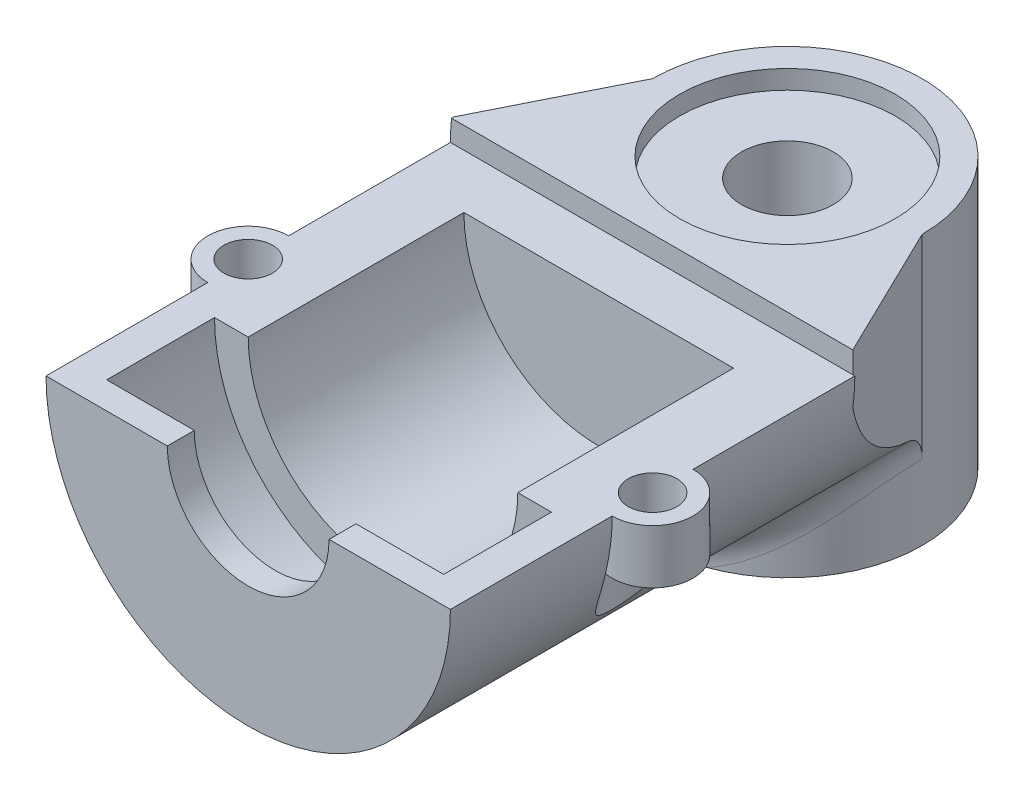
ISO-10303-21;
HEADER;
FILE_DESCRIPTION(('STEP AP214'),'2;1');
FILE_NAME('part.step','',(''),(''),'','','');
FILE_SCHEMA(('AUTOMOTIVE_DESIGN { 1 0 10303 214 1 1 1 1 }'));
ENDSEC;
DATA;
#1=APPLICATION_CONTEXT('core data for automotive mechanical design processes');
#2=APPLICATION_PROTOCOL_DEFINITION('international standard','automotive_design',2000,#1);
#3=PRODUCT_CONTEXT('',#1,'mechanical');
#4=PRODUCT('Part','Part','',(#3));
#5=PRODUCT_RELATED_PRODUCT_CATEGORY('part','',(#4));
#6=PRODUCT_DEFINITION_FORMATION('','',#4);
#7=PRODUCT_DEFINITION_CONTEXT('part definition',#1,'design');
#8=PRODUCT_DEFINITION('design','',#6,#7);
#9=PRODUCT_DEFINITION_SHAPE('','',#8);
#10=(LENGTH_UNIT() NAMED_UNIT(*) SI_UNIT(.MILLI.,.METRE.));
#11=(NAMED_UNIT(*) PLANE_ANGLE_UNIT() SI_UNIT($,.RADIAN.));
#12=(NAMED_UNIT(*) SI_UNIT($,.STERADIAN.) SOLID_ANGLE_UNIT());
#13=UNCERTAINTY_MEASURE_WITH_UNIT(LENGTH_MEASURE(1.E-05),#10,'distance_accuracy_value','');
#14=(GEOMETRIC_REPRESENTATION_CONTEXT(3) GLOBAL_UNCERTAINTY_ASSIGNED_CONTEXT((#13)) GLOBAL_UNIT_ASSIGNED_CONTEXT((#10,
#11,#12)) REPRESENTATION_CONTEXT('',''));
#15=CARTESIAN_POINT('',(0.,0.,0.));
#16=DIRECTION('',(0.,0.,1.));
#17=DIRECTION('',(1.,0.,0.));
#18=AXIS2_PLACEMENT_3D('',#15,#16,#17);
#19=CARTESIAN_POINT('',(0.,9.525,6.35));
#20=DIRECTION('',(0.,-1.,0.));
#21=DIRECTION('',(0.,0.,-1.));
#22=AXIS2_PLACEMENT_3D('',#19,#20,#21);
#23=CYLINDRICAL_SURFACE('',#22,2.159);
#24=CARTESIAN_POINT('',(0.,0.126999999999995,6.35));
#25=DIRECTION('',(0.,1.,0.));
#26=DIRECTION('',(0.,0.,1.));
#27=AXIS2_PLACEMENT_3D('',#24,#25,#26);
#28=CIRCLE('',#27,2.159);
#29=CARTESIAN_POINT('',(0.,0.126999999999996,8.509));
#30=VERTEX_POINT('',#29);
#31=EDGE_CURVE('E328',#30,#30,#28,.F.);
#32=ORIENTED_EDGE('',*,*,#31,.F.);
#33=EDGE_LOOP('',(#32));
#34=FACE_BOUND('',#33,.T.);
#35=CARTESIAN_POINT('',(0.,-10.795,6.35));
#36=DIRECTION('',(0.,-1.,0.));
#37=DIRECTION('',(0.,0.,-1.));
#38=AXIS2_PLACEMENT_3D('',#35,#36,#37);
#39=CIRCLE('',#38,2.159);
#40=CARTESIAN_POINT('',(0.,-10.795,4.191));
#41=VERTEX_POINT('',#40);
#42=EDGE_CURVE('E46',#41,#41,#39,.F.);
#43=ORIENTED_EDGE('',*,*,#42,.F.);
#44=EDGE_LOOP('',(#43));
#45=FACE_BOUND('',#44,.T.);
#46=ADVANCED_FACE('F38',(#34,#45),#23,.F.);
#47=CARTESIAN_POINT('',(0.,0.,31.75));
#48=DIRECTION('',(0.,0.,-1.));
#49=DIRECTION('',(-1.,0.,0.));
#50=AXIS2_PLACEMENT_3D('',#47,#48,#49);
#51=CYLINDRICAL_SURFACE('',#50,9.525);
#52=CARTESIAN_POINT('',(0.,0.,-6.34999999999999));
#53=DIRECTION('',(0.894427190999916,0.,0.447213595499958));
#54=DIRECTION('',(0.447213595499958,0.,-0.894427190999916));
#55=AXIS2_PLACEMENT_3D('',#52,#53,#54);
#56=ELLIPSE('',#55,21.2985474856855,9.525);
#57=CARTESIAN_POINT('',(-9.525,0.,12.7));
#58=VERTEX_POINT('',#57);
#59=CARTESIAN_POINT('',(-6.95344463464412,-6.50962615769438,7.55688926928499));
#60=VERTEX_POINT('',#59);
#61=EDGE_CURVE('E223',#58,#60,#56,.T.);
#62=ORIENTED_EDGE('',*,*,#61,.T.);
#63=CARTESIAN_POINT('',(-6.68541526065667,-6.78460373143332,3.64411511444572));
#64=CARTESIAN_POINT('',(-5.94972490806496,-7.50953855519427,4.10744961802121));
#65=CARTESIAN_POINT('',(-6.04870904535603,-8.59383139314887,4.41722508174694));
#66=CARTESIAN_POINT('',(-6.72764082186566,-6.74298792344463,3.81146155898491));
#67=CARTESIAN_POINT('',(-5.99993613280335,-7.46906451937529,4.24342369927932));
#68=CARTESIAN_POINT('',(-6.08691312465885,-8.54111803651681,4.53675825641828));
#69=CARTESIAN_POINT('',(-6.76621226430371,-6.70420916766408,3.9815128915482));
#70=CARTESIAN_POINT('',(-6.04610610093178,-7.43099527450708,4.38273260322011));
#71=CARTESIAN_POINT('',(-6.12181109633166,-8.49199827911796,4.65822349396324));
#72=CARTESIAN_POINT('',(-6.83564636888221,-6.63340462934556,4.32653565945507));
#73=CARTESIAN_POINT('',(-6.12935139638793,-7.36124789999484,4.66640860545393));
#74=CARTESIAN_POINT('',(-6.18463242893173,-8.40231253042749,4.90466832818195));
#75=CARTESIAN_POINT('',(-6.86650024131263,-6.60138655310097,4.50151245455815));
#76=CARTESIAN_POINT('',(-6.16649178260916,-7.3295189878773,4.81088805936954));
#77=CARTESIAN_POINT('',(-6.21254783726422,-8.36175630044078,5.02965175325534));
#78=CARTESIAN_POINT('',(-6.91997288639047,-6.5453110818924,4.85532849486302));
#79=CARTESIAN_POINT('',(-6.23090426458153,-7.27383514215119,5.10381220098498));
#80=CARTESIAN_POINT('',(-6.26092784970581,-8.29072737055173,5.28237749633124));
#81=CARTESIAN_POINT('',(-6.94260025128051,-6.52124538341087,5.03416350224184));
#82=CARTESIAN_POINT('',(-6.25824910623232,-7.24982054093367,5.25237993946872));
#83=CARTESIAN_POINT('',(-6.28140022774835,-8.26024415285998,5.41011678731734));
#84=CARTESIAN_POINT('',(-6.97925924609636,-6.48199760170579,5.39473304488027));
#85=CARTESIAN_POINT('',(-6.30255176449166,-7.21062419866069,5.55239012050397));
#86=CARTESIAN_POINT('',(-6.3145678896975,-8.21053029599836,5.66766646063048));
#87=CARTESIAN_POINT('',(-6.99329432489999,-6.46681195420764,5.57646638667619));
#88=CARTESIAN_POINT('',(-6.31955932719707,-7.19539937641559,5.70397844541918));
#89=CARTESIAN_POINT('',(-6.32726629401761,-8.19129514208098,5.79747599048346));
#90=CARTESIAN_POINT('',(-7.01256286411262,-6.44591295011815,5.94281165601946));
#91=CARTESIAN_POINT('',(-6.34289226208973,-7.17445516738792,6.00971698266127));
#92=CARTESIAN_POINT('',(-6.34469973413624,-8.16482307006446,6.05915118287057));
#93=CARTESIAN_POINT('',(-7.01773590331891,-6.44026462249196,6.1274347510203));
#94=CARTESIAN_POINT('',(-6.34916970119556,-7.16877833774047,6.16404257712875));
#95=CARTESIAN_POINT('',(-6.34938010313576,-8.15766852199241,6.1910248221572));
#96=CARTESIAN_POINT('',(-7.0189787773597,-6.43891007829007,6.49680574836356));
#97=CARTESIAN_POINT('',(-6.35067582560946,-7.16741912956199,6.47264902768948));
#98=CARTESIAN_POINT('',(-6.35050460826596,-8.15595276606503,6.45486124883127));
#99=CARTESIAN_POINT('',(-7.01504777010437,-6.44320478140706,6.68155366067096));
#100=CARTESIAN_POINT('',(-6.34590514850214,-7.17173617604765,6.62709985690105));
#101=CARTESIAN_POINT('',(-6.34694798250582,-8.16139272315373,6.58682404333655));
#102=CARTESIAN_POINT('',(-6.99818162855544,-6.46151923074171,7.04931236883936));
#103=CARTESIAN_POINT('',(-6.32547774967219,-7.19009592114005,6.934100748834));
#104=CARTESIAN_POINT('',(-6.33168814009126,-8.18459102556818,6.84950883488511));
#105=CARTESIAN_POINT('',(-6.98526038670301,-6.47552397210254,7.23232540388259));
#106=CARTESIAN_POINT('',(-6.30981562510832,-7.20414350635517,7.08681868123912));
#107=CARTESIAN_POINT('',(-6.31999749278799,-8.20233036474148,6.98023243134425));
#108=CARTESIAN_POINT('',(-6.9506983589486,-6.51260729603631,7.59552007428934));
#109=CARTESIAN_POINT('',(-6.26803285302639,-7.24119995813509,7.38916720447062));
#110=CARTESIAN_POINT('',(-6.28872708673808,-8.24930257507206,7.23965719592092));
#111=CARTESIAN_POINT('',(-6.92905677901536,-6.53568670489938,7.77570145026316));
#112=CARTESIAN_POINT('',(-6.24186750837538,-7.26424777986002,7.5389492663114));
#113=CARTESIAN_POINT('',(-6.2691466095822,-8.27853649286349,7.36835817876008));
#114=CARTESIAN_POINT('',(-6.87302459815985,-6.5946251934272,8.16262890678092));
#115=CARTESIAN_POINT('',(-6.17432180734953,-7.32283996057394,7.85961171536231));
#116=CARTESIAN_POINT('',(-6.21845082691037,-8.35319191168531,7.64473493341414));
#117=CARTESIAN_POINT('',(-6.83708621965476,-6.63199520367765,8.36864547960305));
#118=CARTESIAN_POINT('',(-6.131032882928,-7.35990626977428,8.02981463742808));
#119=CARTESIAN_POINT('',(-6.18593515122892,-8.40052725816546,7.79188962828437));
#120=CARTESIAN_POINT('',(-6.75447792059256,-6.71610893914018,8.77414529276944));
#121=CARTESIAN_POINT('',(-6.0320109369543,-7.44272868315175,8.3630689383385));
#122=CARTESIAN_POINT('',(-6.11119430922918,-8.50707132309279,8.08153235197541));
#123=CARTESIAN_POINT('',(-6.70780032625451,-6.76285936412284,8.97362374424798));
#124=CARTESIAN_POINT('',(-5.97614563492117,-7.48858560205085,8.52628517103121));
#125=CARTESIAN_POINT('',(-6.06896219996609,-8.56628852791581,8.22401696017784));
#126=CARTESIAN_POINT('',(-6.60426432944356,-6.86400508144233,9.36579919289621));
#127=CARTESIAN_POINT('',(-5.8529372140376,-7.58693343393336,8.84506982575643));
#128=CARTESIAN_POINT('',(-5.97528677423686,-8.69440643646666,8.50414228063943));
#129=CARTESIAN_POINT('',(-6.5473749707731,-6.91842350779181,9.55847337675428));
#130=CARTESIAN_POINT('',(-5.78542001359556,-7.63953961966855,9.00073877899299));
#131=CARTESIAN_POINT('',(-5.92381544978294,-8.76333644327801,8.64176669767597));
#132=CARTESIAN_POINT('',(-6.42414197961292,-7.03300107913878,9.93594885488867));
#133=CARTESIAN_POINT('',(-5.64014279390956,-7.74916238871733,9.3032796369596));
#134=CARTESIAN_POINT('',(-5.81231893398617,-8.90846803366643,8.91139203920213));
#135=CARTESIAN_POINT('',(-6.35780109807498,-7.09315855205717,10.1207524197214));
#136=CARTESIAN_POINT('',(-5.56223657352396,-7.80626573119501,9.45024211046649));
#137=CARTESIAN_POINT('',(-5.75229623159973,-8.98466749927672,9.04339458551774));
#138=CARTESIAN_POINT('',(-6.19221479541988,-7.23864535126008,10.5434422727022));
#139=CARTESIAN_POINT('',(-5.36901750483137,-7.94289007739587,9.78362261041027));
#140=CARTESIAN_POINT('',(-5.60248005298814,-9.16895077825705,9.34531590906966));
#141=CARTESIAN_POINT('',(-6.08941999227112,-7.32561882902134,10.7781981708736));
#142=CARTESIAN_POINT('',(-5.2499972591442,-8.02337025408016,9.96609600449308));
#143=CARTESIAN_POINT('',(-5.5094752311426,-9.27911718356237,9.51299869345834));
#144=CARTESIAN_POINT('',(-5.8685714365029,-7.50370822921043,11.2332559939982));
#145=CARTESIAN_POINT('',(-4.99766428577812,-8.18485301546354,10.3141476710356));
#146=CARTESIAN_POINT('',(-5.30965987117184,-9.50469709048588,9.83803999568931));
#147=CARTESIAN_POINT('',(-5.75051300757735,-7.5948254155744,11.4535534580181));
#148=CARTESIAN_POINT('',(-4.86399365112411,-8.26596944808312,10.4797306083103));
#149=CARTESIAN_POINT('',(-5.202845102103,-9.62011219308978,9.99539532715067));
#150=CARTESIAN_POINT('',(-5.49960993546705,-7.77843818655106,11.8794828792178));
#151=CARTESIAN_POINT('',(-4.58443429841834,-8.42544772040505,10.793530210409));
#152=CARTESIAN_POINT('',(-4.97583756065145,-9.85268836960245,10.2996306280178));
#153=CARTESIAN_POINT('',(-5.36675534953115,-7.87093466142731,12.0851048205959));
#154=CARTESIAN_POINT('',(-4.43821548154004,-8.50384968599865,10.9416437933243));
#155=CARTESIAN_POINT('',(-4.85563579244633,-9.96985057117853,10.4465034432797));
#156=CARTESIAN_POINT('',(-5.08671675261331,-8.054749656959,12.4809225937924));
#157=CARTESIAN_POINT('',(-4.1359410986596,-8.6550329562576,11.2197857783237));
#158=CARTESIAN_POINT('',(-4.60226753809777,-10.2026828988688,10.7292304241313));
#159=CARTESIAN_POINT('',(-4.93953434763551,-8.14606830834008,12.6711201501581));
#160=CARTESIAN_POINT('',(-3.97962172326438,-8.72778097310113,11.3496315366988));
#161=CARTESIAN_POINT('',(-4.4691025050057,-10.3183531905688,10.8650858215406));
#162=CARTESIAN_POINT('',(-4.62947381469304,-8.32622923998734,13.0371841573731));
#163=CARTESIAN_POINT('',(-3.65792093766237,-8.86613308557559,11.5920681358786));
#164=CARTESIAN_POINT('',(-4.18857154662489,-10.5465570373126,11.1265601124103));
#165=CARTESIAN_POINT('',(-4.46644323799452,-8.41503408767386,13.2128734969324));
#166=CARTESIAN_POINT('',(-3.49231011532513,-8.93152618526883,11.7041564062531));
#167=CARTESIAN_POINT('',(-4.04106769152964,-10.6590431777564,11.2520524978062));
#168=CARTESIAN_POINT('',(-4.12634676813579,-8.58692050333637,13.5463788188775));
#169=CARTESIAN_POINT('',(-3.15652436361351,-9.05248631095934,11.9090929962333));
#170=CARTESIAN_POINT('',(-3.73336136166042,-10.8767659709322,11.4902705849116));
#171=CARTESIAN_POINT('',(-3.94927330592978,-8.66999893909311,13.7041850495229));
#172=CARTESIAN_POINT('',(-2.98630170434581,-9.10786420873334,12.0015742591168));
#173=CARTESIAN_POINT('',(-3.57315203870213,-10.9819986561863,11.6029893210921));
#174=CARTESIAN_POINT('',(-3.58246203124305,-8.82787131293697,13.9995818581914));
#175=CARTESIAN_POINT('',(-2.64531288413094,-9.20748693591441,12.1670601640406));
#176=CARTESIAN_POINT('',(-3.24127517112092,-11.1819703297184,11.813987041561));
#177=CARTESIAN_POINT('',(-3.39277399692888,-8.90269503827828,14.1372457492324));
#178=CARTESIAN_POINT('',(-2.47466022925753,-9.25154638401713,12.2397436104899));
#179=CARTESIAN_POINT('',(-3.06965266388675,-11.2767470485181,11.9123183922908));
#180=CARTESIAN_POINT('',(-3.00123123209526,-9.04219830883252,14.3910015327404));
#181=CARTESIAN_POINT('',(-2.13556284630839,-9.32857674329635,12.3669132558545));
#182=CARTESIAN_POINT('',(-2.71539968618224,-11.4534511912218,12.0935725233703));
#183=CARTESIAN_POINT('',(-2.79938814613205,-9.10688735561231,14.5071136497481));
#184=CARTESIAN_POINT('',(-1.96741621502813,-9.36131553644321,12.4210179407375));
#185=CARTESIAN_POINT('',(-2.53277975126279,-11.535390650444,12.1765097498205));
#186=CARTESIAN_POINT('',(-2.44251846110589,-9.20781926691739,14.6867726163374));
#187=CARTESIAN_POINT('',(-1.6825266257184,-9.40876782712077,12.4999473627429));
#188=CARTESIAN_POINT('',(-2.20989765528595,-11.6632377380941,12.3048375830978));
#189=CARTESIAN_POINT('',(-2.2900679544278,-9.24697168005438,14.7559604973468));
#190=CARTESIAN_POINT('',(-1.56428003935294,-9.42593262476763,12.5286861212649));
#191=CARTESIAN_POINT('',(-2.07196624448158,-11.7128307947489,12.3542574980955));
#192=CARTESIAN_POINT('',(-1.98029006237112,-9.31822539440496,14.881271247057));
#193=CARTESIAN_POINT('',(-1.33090307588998,-9.45546972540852,12.5785166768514));
#194=CARTESIAN_POINT('',(-1.79169100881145,-11.8030854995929,12.443765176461));
#195=CARTESIAN_POINT('',(-1.82296450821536,-9.35032930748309,14.9373989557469));
#196=CARTESIAN_POINT('',(-1.21598738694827,-9.46777541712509,12.599500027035));
#197=CARTESIAN_POINT('',(-1.64934884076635,-11.8437504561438,12.4838563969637));
#198=CARTESIAN_POINT('',(-1.50317984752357,-9.40704962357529,15.036224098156));
#199=CARTESIAN_POINT('',(-0.988603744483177,-9.48840728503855,12.6350149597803));
#200=CARTESIAN_POINT('',(-1.36001986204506,-11.9155961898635,12.5544457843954));
#201=CARTESIAN_POINT('',(-1.3406927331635,-9.43161262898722,15.0788258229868));
#202=CARTESIAN_POINT('',(-0.876412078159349,-9.49665297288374,12.6494138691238));
#203=CARTESIAN_POINT('',(-1.21300771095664,-11.9467093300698,12.5848755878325));
#204=CARTESIAN_POINT('',(-1.01258905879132,-9.47247595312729,15.1495252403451));
#205=CARTESIAN_POINT('',(-0.654590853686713,-9.50975616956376,12.6725163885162));
#206=CARTESIAN_POINT('',(-0.916152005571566,-11.9984695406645,12.6353751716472));
#207=CARTESIAN_POINT('',(-0.846969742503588,-9.48876860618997,15.1776094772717));
#208=CARTESIAN_POINT('',(-0.545226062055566,-9.5145765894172,12.6811564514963));
#209=CARTESIAN_POINT('',(-0.766305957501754,-12.0191069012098,12.6554353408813));
#210=CARTESIAN_POINT('',(-0.680414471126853,-9.50066635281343,15.1981241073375));
#211=CARTESIAN_POINT('',(-0.437110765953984,-9.51809116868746,12.6874758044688));
#212=CARTESIAN_POINT('',(-0.615613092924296,-12.0341773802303,12.6700886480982));
#213=(BOUNDED_SURFACE() B_SPLINE_SURFACE(3,2,((#63,#64,#65),(#66,#67,#68),(#69,#70,#71),(#72,
#73,#74),(#75,#76,#77),(#78,#79,#80),(#81,#82,#83),(#84,#85,#86),(#87,#88,#89),(#90,#91,#92),
(#93,#94,#95),(#96,#97,#98),(#99,#100,#101),(#102,#103,#104),(#105,#106,#107),(#108,#109,#110),
(#111,#112,#113),(#114,#115,#116),(#117,#118,#119),(#120,#121,#122),(#123,#124,#125),(#126,#127,
#128),(#129,#130,#131),(#132,#133,#134),(#135,#136,#137),(#138,#139,#140),(#141,#142,#143),
(#144,#145,#146),(#147,#148,#149),(#150,#151,#152),(#153,#154,#155),(#156,#157,#158),(#159,#160,
#161),(#162,#163,#164),(#165,#166,#167),(#168,#169,#170),(#171,#172,#173),(#174,#175,#176),
(#177,#178,#179),(#180,#181,#182),(#183,#184,#185),(#186,#187,#188),(#189,#190,#191),(#192,#193,
#194),(#195,#196,#197),(#198,#199,#200),(#201,#202,#203),(#204,#205,#206),(#207,#208,#209),
(#210,#211,#212)),.UNSPECIFIED.,.F.,.F.,.F.) B_SPLINE_SURFACE_WITH_KNOTS((4,2,2,2,2,2,2,2,2,2,2,
2,2,2,2,2,2,2,2,2,2,2,2,2,4),(3,3),(0.,0.550286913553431,1.10119773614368,1.65153149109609,
2.20164420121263,2.75549285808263,3.30939274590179,3.86243859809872,4.4155348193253,
5.06326392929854,5.71145732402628,6.36164991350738,7.01165364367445,7.88099306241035,
8.750599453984,9.6207937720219,10.4908906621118,11.370391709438,12.2503700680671,
13.1270612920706,14.0029256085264,14.6354090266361,15.2676576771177,15.9042852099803,
16.5415017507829),(0.,1.),
.UNSPECIFIED.) GEOMETRIC_REPRESENTATION_ITEM() RATIONAL_B_SPLINE_SURFACE(((1.,0.913394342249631,
1.),(1.,0.915706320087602,1.),(1.,0.917830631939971,1.),(1.,0.921670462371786,1.),(1.,
0.923385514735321,1.),(1.,0.926366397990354,1.),(1.,0.927632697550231,1.),(1.,0.929687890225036,
1.),(1.,0.930476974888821,1.),(1.,0.931560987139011,1.),(1.,0.93185252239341,1.),(1.,
0.931922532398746,1.),(1.,0.931700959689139,1.),(1.,0.93075181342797,1.),(1.,0.930025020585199,
1.),(1.,0.928086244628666,1.),(1.,0.926874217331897,1.),(1.,0.923748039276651,1.),(1.,
0.921749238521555,1.),(1.,0.917182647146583,1.),(1.,0.914614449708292,1.),(1.,0.908961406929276,
1.),(1.,0.905874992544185,1.),(1.,0.899251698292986,1.),(1.,0.895714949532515,1.),(1.,
0.886985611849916,1.),(1.,0.881636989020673,1.),(1.,0.870362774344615,1.),(1.,0.864437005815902,
1.),(1.,0.852137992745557,1.),(1.,0.845764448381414,1.),(1.,0.832719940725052,1.),(1.,
0.82604901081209,1.),(1.,0.812504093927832,1.),(1.,0.805628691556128,1.),(1.,0.791946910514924,
1.),(1.,0.785140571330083,1.),(1.,0.771870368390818,1.),(1.,0.765405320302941,1.),(1.,
0.753074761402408,1.),(1.,0.747208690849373,1.),(1.,0.737881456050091,1.),(1.,0.734204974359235,
1.),(1.,0.727435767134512,1.),(1.,0.724342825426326,1.),(1.,0.718829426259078,1.),(1.,
0.716413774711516,1.),(1.,0.712369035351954,1.),(1.,0.710740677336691,1.),(1.,0.709551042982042,1.))) REPRESENTATION_ITEM('') SURFACE());
#214=CARTESIAN_POINT('',(-6.68541526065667,-6.78460373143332,3.64411511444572));
#215=CARTESIAN_POINT('',(-6.72764082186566,-6.74298792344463,3.81146155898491));
#216=CARTESIAN_POINT('',(-6.76621226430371,-6.70420916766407,3.9815128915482));
#217=CARTESIAN_POINT('',(-6.83564636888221,-6.63340462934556,4.32653565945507));
#218=CARTESIAN_POINT('',(-6.86650024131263,-6.60138655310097,4.50151245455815));
#219=CARTESIAN_POINT('',(-6.91997288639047,-6.5453110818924,4.85532849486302));
#220=CARTESIAN_POINT('',(-6.94260025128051,-6.52124538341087,5.03416350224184));
#221=CARTESIAN_POINT('',(-6.97925924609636,-6.48199760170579,5.39473304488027));
#222=CARTESIAN_POINT('',(-6.99329432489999,-6.46681195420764,5.57646638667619));
#223=CARTESIAN_POINT('',(-7.01256286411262,-6.44591295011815,5.94281165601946));
#224=CARTESIAN_POINT('',(-7.01773590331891,-6.44026462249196,6.1274347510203));
#225=CARTESIAN_POINT('',(-7.0189787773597,-6.43891007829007,6.49680574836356));
#226=CARTESIAN_POINT('',(-7.01504777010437,-6.44320478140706,6.68155366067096));
#227=CARTESIAN_POINT('',(-6.99818162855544,-6.46151923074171,7.04931236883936));
#228=CARTESIAN_POINT('',(-6.98526038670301,-6.47552397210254,7.23232540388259));
#229=CARTESIAN_POINT('',(-6.9506983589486,-6.51260729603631,7.59552007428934));
#230=CARTESIAN_POINT('',(-6.92905677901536,-6.53568670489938,7.77570145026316));
#231=CARTESIAN_POINT('',(-6.87302459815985,-6.5946251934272,8.16262890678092));
#232=CARTESIAN_POINT('',(-6.83708621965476,-6.63199520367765,8.36864547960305));
#233=CARTESIAN_POINT('',(-6.75447792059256,-6.71610893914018,8.77414529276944));
#234=CARTESIAN_POINT('',(-6.70780032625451,-6.76285936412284,8.97362374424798));
#235=CARTESIAN_POINT('',(-6.60426432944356,-6.86400508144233,9.36579919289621));
#236=CARTESIAN_POINT('',(-6.5473749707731,-6.91842350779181,9.55847337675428));
#237=CARTESIAN_POINT('',(-6.42414197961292,-7.03300107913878,9.93594885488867));
#238=CARTESIAN_POINT('',(-6.35780109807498,-7.09315855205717,10.1207524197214));
#239=CARTESIAN_POINT('',(-6.19221479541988,-7.23864535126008,10.5434422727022));
#240=CARTESIAN_POINT('',(-6.08941999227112,-7.32561882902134,10.7781981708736));
#241=CARTESIAN_POINT('',(-5.8685714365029,-7.50370822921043,11.2332559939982));
#242=CARTESIAN_POINT('',(-5.75051300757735,-7.5948254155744,11.4535534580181));
#243=CARTESIAN_POINT('',(-5.49960993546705,-7.77843818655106,11.8794828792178));
#244=CARTESIAN_POINT('',(-5.36675534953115,-7.87093466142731,12.0851048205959));
#245=CARTESIAN_POINT('',(-5.08671675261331,-8.054749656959,12.4809225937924));
#246=CARTESIAN_POINT('',(-4.93953434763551,-8.14606830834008,12.6711201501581));
#247=CARTESIAN_POINT('',(-4.62947381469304,-8.32622923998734,13.0371841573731));
#248=CARTESIAN_POINT('',(-4.46644323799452,-8.41503408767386,13.2128734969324));
#249=CARTESIAN_POINT('',(-4.12634676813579,-8.58692050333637,13.5463788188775));
#250=CARTESIAN_POINT('',(-3.94927330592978,-8.66999893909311,13.7041850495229));
#251=CARTESIAN_POINT('',(-3.58246203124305,-8.82787131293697,13.9995818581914));
#252=CARTESIAN_POINT('',(-3.39277399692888,-8.90269503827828,14.1372457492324));
#253=CARTESIAN_POINT('',(-3.00123123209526,-9.04219830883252,14.3910015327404));
#254=CARTESIAN_POINT('',(-2.79938814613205,-9.10688735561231,14.5071136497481));
#255=CARTESIAN_POINT('',(-2.44251846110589,-9.20781926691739,14.6867726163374));
#256=CARTESIAN_POINT('',(-2.2900679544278,-9.24697168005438,14.7559604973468));
#257=CARTESIAN_POINT('',(-1.98029006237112,-9.31822539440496,14.881271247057));
#258=CARTESIAN_POINT('',(-1.82296450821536,-9.35032930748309,14.9373989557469));
#259=CARTESIAN_POINT('',(-1.50317984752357,-9.40704962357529,15.036224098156));
#260=CARTESIAN_POINT('',(-1.3406927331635,-9.43161262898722,15.0788258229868));
#261=CARTESIAN_POINT('',(-1.01258905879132,-9.47247595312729,15.1495252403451));
#262=CARTESIAN_POINT('',(-0.846969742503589,-9.48876860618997,15.1776094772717));
#263=CARTESIAN_POINT('',(-0.680414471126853,-9.50066635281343,15.1981241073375));
#264=B_SPLINE_CURVE_WITH_KNOTS('',3,(#214,#215,#216,#217,#218,#219,#220,#221,#222,#223,#224,
#225,#226,#227,#228,#229,#230,#231,#232,#233,#234,#235,#236,#237,#238,#239,#240,#241,#242,#243,
#244,#245,#246,#247,#248,#249,#250,#251,#252,#253,#254,#255,#256,#257,#258,#259,#260,#261,#262,
#263),.UNSPECIFIED.,.F.,.F.,(4,2,2,2,2,2,2,2,2,2,2,2,2,2,2,2,2,2,2,2,2,2,2,2,4),(0.,
0.550286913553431,1.10119773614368,1.65153149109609,2.20164420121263,2.75549285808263,
3.30939274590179,3.86243859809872,4.4155348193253,5.06326392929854,5.71145732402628,
6.36164991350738,7.01165364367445,7.88099306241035,8.750599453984,9.6207937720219,
10.4908906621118,11.370391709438,12.2503700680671,13.1270612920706,14.0029256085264,
14.6354090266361,15.2676576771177,15.9042852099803,16.5415017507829),.UNSPECIFIED.);
#265=CARTESIAN_POINT('',(-2.37477686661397,-9.2242105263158,14.7156279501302));
#266=VERTEX_POINT('',#265);
#267=EDGE_CURVE('E59',#60,#266,#264,.T.);
#268=ORIENTED_EDGE('',*,*,#267,.T.);
#269=CARTESIAN_POINT('',(3.50871214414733,-11.684,11.642583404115));
#270=CARTESIAN_POINT('',(2.4445119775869,-9.33176926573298,11.6084485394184));
#271=CARTESIAN_POINT('',(3.84185157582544,-8.71583624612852,13.6904536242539));
#272=CARTESIAN_POINT('',(3.40338820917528,-11.684,11.7123958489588));
#273=CARTESIAN_POINT('',(2.39245966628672,-9.33402649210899,11.6969984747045));
#274=CARTESIAN_POINT('',(3.7334584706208,-8.76363902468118,13.8005681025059));
#275=CARTESIAN_POINT('',(3.29594260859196,-11.684,11.7791126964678));
#276=CARTESIAN_POINT('',(2.33626513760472,-9.33787944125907,11.7831836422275));
#277=CARTESIAN_POINT('',(3.62096216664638,-8.8107879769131,13.9046148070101));
#278=CARTESIAN_POINT('',(3.07691735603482,-11.684,11.9061800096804));
#279=CARTESIAN_POINT('',(2.21602414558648,-9.34819413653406,11.9488891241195));
#280=CARTESIAN_POINT('',(3.38864669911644,-8.90270641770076,14.1003869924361));
#281=CARTESIAN_POINT('',(2.96533981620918,-11.684,11.9665336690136));
#282=CARTESIAN_POINT('',(2.15201837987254,-9.35463442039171,12.0285157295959));
#283=CARTESIAN_POINT('',(3.26883125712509,-8.94747709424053,14.1921186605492));
#284=CARTESIAN_POINT('',(2.73851064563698,-11.684,12.0805404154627));
#285=CARTESIAN_POINT('',(2.01634755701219,-9.36952462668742,12.1800450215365));
#286=CARTESIAN_POINT('',(3.02314507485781,-9.03344429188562,14.3628424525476));
#287=CARTESIAN_POINT('',(2.62327559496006,-11.684,12.1342194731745));
#288=CARTESIAN_POINT('',(1.94473999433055,-9.37795415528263,12.2520796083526));
#289=CARTESIAN_POINT('',(2.89730062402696,-9.07465446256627,14.4418843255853));
#290=CARTESIAN_POINT('',(2.38884627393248,-11.684,12.2349122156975));
#291=CARTESIAN_POINT('',(1.79386395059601,-9.39604713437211,12.3879212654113));
#292=CARTESIAN_POINT('',(2.64000918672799,-9.15281656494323,14.5878110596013));
#293=CARTESIAN_POINT('',(2.26965146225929,-11.684,12.2819249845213));
#294=CARTESIAN_POINT('',(1.71459829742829,-9.40570797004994,12.4518349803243));
#295=CARTESIAN_POINT('',(2.50856143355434,-9.18976791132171,14.6546942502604));
#296=CARTESIAN_POINT('',(2.01656451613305,-11.684,12.3729270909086));
#297=CARTESIAN_POINT('',(1.54139612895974,-9.4262686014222,12.5759311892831));
#298=CARTESIAN_POINT('',(2.22883523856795,-9.26178295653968,14.7820987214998));
#299=CARTESIAN_POINT('',(1.88232107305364,-11.684,12.4162534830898));
#300=CARTESIAN_POINT('',(1.44669866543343,-9.43721505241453,12.6354212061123));
#301=CARTESIAN_POINT('',(2.08011280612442,-9.29637000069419,14.8414896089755));
#302=CARTESIAN_POINT('',(1.60990160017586,-11.684,12.4941675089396));
#303=CARTESIAN_POINT('',(1.24974046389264,-9.45833368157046,12.7425716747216));
#304=CARTESIAN_POINT('',(1.77824581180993,-9.35880538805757,14.9466051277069));
#305=CARTESIAN_POINT('',(1.47172379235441,-11.684,12.5287511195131));
#306=CARTESIAN_POINT('',(1.14740755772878,-9.46852239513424,12.7903598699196));
#307=CARTESIAN_POINT('',(1.62509925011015,-9.38665062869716,14.9923234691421));
#308=CARTESIAN_POINT('',(1.19202805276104,-11.684,12.5887537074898));
#309=CARTESIAN_POINT('',(0.936534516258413,-9.48701973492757,12.8732803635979));
#310=CARTESIAN_POINT('',(1.31539625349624,-9.43503862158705,15.0706233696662));
#311=CARTESIAN_POINT('',(1.05050615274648,-11.684,12.6141611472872));
#312=CARTESIAN_POINT('',(0.827874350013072,-9.49534734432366,12.9085125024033));
#313=CARTESIAN_POINT('',(1.15883578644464,-9.45557218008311,15.1031883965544));
#314=CARTESIAN_POINT('',(0.765180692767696,-11.684,12.6553766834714));
#315=CARTESIAN_POINT('',(0.606268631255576,-9.50920134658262,12.9656152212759));
#316=CARTESIAN_POINT('',(0.84357326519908,-9.48889556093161,15.1555579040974));
#317=CARTESIAN_POINT('',(0.621376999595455,-11.684,12.6711842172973));
#318=CARTESIAN_POINT('',(0.493172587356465,-9.51474711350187,12.987571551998));
#319=CARTESIAN_POINT('',(0.684871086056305,-9.50168492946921,15.1753616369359));
#320=CARTESIAN_POINT('',(0.329544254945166,-11.684,12.6931656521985));
#321=CARTESIAN_POINT('',(0.262401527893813,-9.52251943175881,13.0180587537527));
#322=CARTESIAN_POINT('',(0.363069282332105,-9.51946992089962,15.2028067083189));
#323=CARTESIAN_POINT('',(0.181489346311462,-11.684,12.6991334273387));
#324=CARTESIAN_POINT('',(0.144489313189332,-9.52468777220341,13.0263535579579));
#325=CARTESIAN_POINT('',(0.199946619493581,-9.52429878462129,15.2101878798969));
#326=CARTESIAN_POINT('',(-0.114646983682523,-11.684,12.7006906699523));
#327=CARTESIAN_POINT('',(-0.091260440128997,-9.52524881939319,13.0285141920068));
#328=CARTESIAN_POINT('',(-0.126306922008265,-9.52555888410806,15.2121188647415));
#329=CARTESIAN_POINT('',(-0.262728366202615,-11.684,12.6962846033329));
#330=CARTESIAN_POINT('',(-0.209297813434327,-9.52364410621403,13.0223898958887));
#331=CARTESIAN_POINT('',(-0.289437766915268,-9.52199373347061,15.206674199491));
#332=CARTESIAN_POINT('',(-0.557704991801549,-11.684,12.6771872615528));
#333=CARTESIAN_POINT('',(-0.44296864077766,-9.51685809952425,12.9958997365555));
#334=CARTESIAN_POINT('',(-0.614632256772,-9.50654161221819,15.1828726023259));
#335=CARTESIAN_POINT('',(-0.704600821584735,-11.684,12.6625014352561));
#336=CARTESIAN_POINT('',(-0.558794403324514,-9.5116674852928,12.9754972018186));
#337=CARTESIAN_POINT('',(-0.776696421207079,-9.49465905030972,15.1645225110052));
#338=CARTESIAN_POINT('',(-0.996106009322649,-11.684,12.6231092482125));
#339=CARTESIAN_POINT('',(-0.785899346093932,-9.49830982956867,12.9209092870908));
#340=CARTESIAN_POINT('',(-1.09868845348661,-9.46280469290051,15.1146160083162));
#341=CARTESIAN_POINT('',(-1.1407162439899,-11.684,12.5984068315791));
#342=CARTESIAN_POINT('',(-0.897344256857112,-9.49012399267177,12.8866425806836));
#343=CARTESIAN_POINT('',(-1.25861713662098,-9.44283608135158,15.0830647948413));
#344=CARTESIAN_POINT('',(-1.43213234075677,-11.684,12.5382519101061));
#345=CARTESIAN_POINT('',(-1.11795698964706,-9.47135586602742,12.8034707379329));
#346=CARTESIAN_POINT('',(-1.58123228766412,-9.39430252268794,15.0048355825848));
#347=CARTESIAN_POINT('',(-1.57881554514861,-11.684,12.5024293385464));
#348=CARTESIAN_POINT('',(-1.22699599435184,-9.46067165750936,12.7539388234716));
#349=CARTESIAN_POINT('',(-1.74379552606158,-9.36544195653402,14.9576322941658));
#350=CARTESIAN_POINT('',(-1.86785194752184,-11.684,12.4209287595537));
#351=CARTESIAN_POINT('',(-1.43653086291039,-9.43839213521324,12.6418176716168));
#352=CARTESIAN_POINT('',(-2.06408283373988,-9.30010283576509,14.8478985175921));
#353=CARTESIAN_POINT('',(-2.01020569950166,-11.684,12.3752520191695));
#354=CARTESIAN_POINT('',(-1.53711212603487,-9.42677639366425,12.5790727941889));
#355=CARTESIAN_POINT('',(-2.22180752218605,-9.26362526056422,14.7853699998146));
#356=CARTESIAN_POINT('',(-2.29046831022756,-11.684,12.2744008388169));
#357=CARTESIAN_POINT('',(-1.72891334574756,-9.40400936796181,12.4415047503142));
#358=CARTESIAN_POINT('',(-2.53156898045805,-9.18381119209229,14.6441438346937));
#359=CARTESIAN_POINT('',(-2.42835968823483,-11.684,12.2191934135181));
#360=CARTESIAN_POINT('',(-1.82012802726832,-9.39285142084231,12.3664735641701));
#361=CARTESIAN_POINT('',(-2.68358368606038,-9.1404509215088,14.5653898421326));
#362=CARTESIAN_POINT('',(-2.69891606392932,-11.684,12.0998015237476));
#363=CARTESIAN_POINT('',(-1.99236858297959,-9.37231771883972,12.2057635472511));
#364=CARTESIAN_POINT('',(-2.98000469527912,-9.04817923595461,14.3914419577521));
#365=CARTESIAN_POINT('',(-2.83157719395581,-11.684,12.0356105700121));
#366=CARTESIAN_POINT('',(-2.07337616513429,-9.36294957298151,12.1199090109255));
#367=CARTESIAN_POINT('',(-3.12440539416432,-8.99926381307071,14.2962361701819));
#368=CARTESIAN_POINT('',(-2.96139653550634,-11.684,11.9671728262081));
#369=CARTESIAN_POINT('',(-2.1485324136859,-9.35520390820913,12.0298895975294));
#370=CARTESIAN_POINT('',(-3.26422207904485,-8.94821095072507,14.1926577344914));
#371=(BOUNDED_SURFACE() B_SPLINE_SURFACE(3,2,((#269,#270,#271),(#272,#273,#274),(#275,#276,
#277),(#278,#279,#280),(#281,#282,#283),(#284,#285,#286),(#287,#288,#289),(#290,#291,#292),
(#293,#294,#295),(#296,#297,#298),(#299,#300,#301),(#302,#303,#304),(#305,#306,#307),(#308,#309,
#310),(#311,#312,#313),(#314,#315,#316),(#317,#318,#319),(#320,#321,#322),(#323,#324,#325),
(#326,#327,#328),(#329,#330,#331),(#332,#333,#334),(#335,#336,#337),(#338,#339,#340),(#341,#342,
#343),(#344,#345,#346),(#347,#348,#349),(#350,#351,#352),(#353,#354,#355),(#356,#357,#358),
(#359,#360,#361),(#362,#363,#364),(#365,#366,#367),(#368,#369,#370)),.UNSPECIFIED.,.F.,.F.,
.F.) B_SPLINE_SURFACE_WITH_KNOTS((4,2,2,2,2,2,2,2,2,2,2,2,2,2,2,2,4),(3,3),(0.,
0.558166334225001,1.11605118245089,1.67169246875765,2.22741002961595,2.83362588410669,
3.4401201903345,4.04737443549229,4.654664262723,5.27452123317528,5.89411140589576,
6.51337340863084,7.13239180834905,7.77474007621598,8.41700580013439,9.06154065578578,
9.70654351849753),(0.,1.),
.UNSPECIFIED.) GEOMETRIC_REPRESENTATION_ITEM() RATIONAL_B_SPLINE_SURFACE(((1.,0.701286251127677,
1.),(1.,0.704624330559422,1.),(1.,0.70787551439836,1.),(1.,0.714180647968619,1.),(1.,
0.717234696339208,1.),(1.,0.723113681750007,1.),(1.,0.725939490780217,1.),(1.,0.731337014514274,
1.),(1.,0.733908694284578,1.),(1.,0.738969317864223,1.),(1.,0.741429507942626,1.),(1.,
0.745919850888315,1.),(1.,0.747949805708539,1.),(1.,0.751511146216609,1.),(1.,0.753041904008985,
1.),(1.,0.755542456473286,1.),(1.,0.756512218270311,1.),(1.,0.757864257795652,1.),(1.,
0.758233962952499,1.),(1.,0.758330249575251,1.),(1.,0.758057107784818,1.),(1.,0.756880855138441,
1.),(1.,0.755978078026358,1.),(1.,0.753582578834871,1.),(1.,0.752090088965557,1.),(1.,
0.748509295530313,1.),(1.,0.746400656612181,1.),(1.,0.741694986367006,1.),(1.,0.739098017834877,
1.),(1.,0.733490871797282,1.),(1.,0.730479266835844,1.),(1.,0.724118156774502,1.),(1.,
0.720768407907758,1.),(1.,0.717285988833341,1.))) REPRESENTATION_ITEM('') SURFACE());
#372=CARTESIAN_POINT('',(-3.26422207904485,-8.94821095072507,14.1926577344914));
#373=CARTESIAN_POINT('',(-3.12440539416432,-8.99926381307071,14.2962361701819));
#374=CARTESIAN_POINT('',(-2.98000469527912,-9.04817923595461,14.3914419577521));
#375=CARTESIAN_POINT('',(-2.68358368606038,-9.1404509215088,14.5653898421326));
#376=CARTESIAN_POINT('',(-2.53156898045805,-9.18381119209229,14.6441438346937));
#377=CARTESIAN_POINT('',(-2.22180752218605,-9.26362526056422,14.7853699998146));
#378=CARTESIAN_POINT('',(-2.06408283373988,-9.30010283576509,14.8478985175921));
#379=CARTESIAN_POINT('',(-1.74379552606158,-9.36544195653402,14.9576322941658));
#380=CARTESIAN_POINT('',(-1.58123228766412,-9.39430252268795,15.0048355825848));
#381=CARTESIAN_POINT('',(-1.25861713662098,-9.44283608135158,15.0830647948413));
#382=CARTESIAN_POINT('',(-1.09868845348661,-9.46280469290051,15.1146160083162));
#383=CARTESIAN_POINT('',(-0.776696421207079,-9.49465905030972,15.1645225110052));
#384=CARTESIAN_POINT('',(-0.614632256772,-9.50654161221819,15.1828726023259));
#385=CARTESIAN_POINT('',(-0.289437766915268,-9.52199373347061,15.206674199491));
#386=CARTESIAN_POINT('',(-0.126306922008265,-9.52555888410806,15.2121188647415));
#387=CARTESIAN_POINT('',(0.199946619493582,-9.52429878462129,15.2101878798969));
#388=CARTESIAN_POINT('',(0.363069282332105,-9.51946992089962,15.2028067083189));
#389=CARTESIAN_POINT('',(0.684871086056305,-9.50168492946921,15.1753616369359));
#390=CARTESIAN_POINT('',(0.84357326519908,-9.48889556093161,15.1555579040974));
#391=CARTESIAN_POINT('',(1.15883578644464,-9.45557218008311,15.1031883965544));
#392=CARTESIAN_POINT('',(1.31539625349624,-9.43503862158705,15.0706233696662));
#393=CARTESIAN_POINT('',(1.62509925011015,-9.38665062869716,14.9923234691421));
#394=CARTESIAN_POINT('',(1.77824581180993,-9.35880538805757,14.9466051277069));
#395=CARTESIAN_POINT('',(2.08011280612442,-9.29637000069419,14.8414896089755));
#396=CARTESIAN_POINT('',(2.22883523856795,-9.26178295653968,14.7820987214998));
#397=CARTESIAN_POINT('',(2.50856143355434,-9.18976791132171,14.6546942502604));
#398=CARTESIAN_POINT('',(2.64000918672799,-9.15281656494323,14.5878110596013));
#399=CARTESIAN_POINT('',(2.89730062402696,-9.07465446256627,14.4418843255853));
#400=CARTESIAN_POINT('',(3.02314507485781,-9.03344429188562,14.3628424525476));
#401=CARTESIAN_POINT('',(3.26883125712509,-8.94747709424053,14.1921186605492));
#402=CARTESIAN_POINT('',(3.38864669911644,-8.90270641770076,14.1003869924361));
#403=CARTESIAN_POINT('',(3.62096216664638,-8.8107879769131,13.9046148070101));
#404=CARTESIAN_POINT('',(3.7334584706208,-8.76363902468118,13.8005681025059));
#405=CARTESIAN_POINT('',(3.84185157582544,-8.71583624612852,13.6904536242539));
#406=B_SPLINE_CURVE_WITH_KNOTS('',3,(#372,#373,#374,#375,#376,#377,#378,#379,#380,#381,#382,
#383,#384,#385,#386,#387,#388,#389,#390,#391,#392,#393,#394,#395,#396,#397,#398,#399,#400,#401,
#402,#403,#404,#405),.UNSPECIFIED.,.F.,.F.,(4,2,2,2,2,2,2,2,2,2,2,2,2,2,2,2,4),(0.,
0.64500286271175,1.28953771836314,1.93180344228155,2.57415171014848,3.19317010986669,
3.81243211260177,4.43202228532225,5.05187925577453,5.65916908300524,6.26642332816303,
6.87291763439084,7.47913348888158,8.03485104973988,8.59049233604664,9.14837718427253,
9.70654351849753),.UNSPECIFIED.);
#407=CARTESIAN_POINT('',(2.37477686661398,-9.2242105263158,14.7156279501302));
#408=VERTEX_POINT('',#407);
#409=EDGE_CURVE('E64',#266,#408,#406,.T.);
#410=ORIENTED_EDGE('',*,*,#409,.T.);
#411=CARTESIAN_POINT('',(1.38098259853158,-9.42435738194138,15.0662057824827));
#412=CARTESIAN_POINT('',(0.905275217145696,-9.49406437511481,12.6449353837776));
#413=CARTESIAN_POINT('',(1.24946044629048,-11.9375193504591,12.5758612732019));
#414=CARTESIAN_POINT('',(1.56708019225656,-9.39712646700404,15.0189390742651));
#415=CARTESIAN_POINT('',(1.03283731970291,-9.48489739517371,12.6289095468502));
#416=CARTESIAN_POINT('',(1.4178344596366,-11.9030268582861,12.5420993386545));
#417=CARTESIAN_POINT('',(1.75080937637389,-9.36453699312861,14.9622494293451));
#418=CARTESIAN_POINT('',(1.16325017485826,-9.47329920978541,12.6089081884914));
#419=CARTESIAN_POINT('',(1.58406562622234,-11.8617468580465,12.5016067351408));
#420=CARTESIAN_POINT('',(2.11206091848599,-9.28970471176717,14.8312363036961));
#421=CARTESIAN_POINT('',(1.42864943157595,-9.44400477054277,12.5590990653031));
#422=CARTESIAN_POINT('',(1.91091225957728,-11.7669593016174,12.4080259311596));
#423=CARTESIAN_POINT('',(2.28959020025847,-9.24747309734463,14.7569332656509));
#424=CARTESIAN_POINT('',(1.5632818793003,-9.42640865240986,12.529455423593));
#425=CARTESIAN_POINT('',(2.07153399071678,-11.7134659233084,12.3549523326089));
#426=CARTESIAN_POINT('',(2.63602635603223,-9.15472249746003,14.5924467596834));
#427=CARTESIAN_POINT('',(1.83568239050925,-9.38423790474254,12.4590735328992));
#428=CARTESIAN_POINT('',(2.38497622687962,-11.5959818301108,12.2374619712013));
#429=CARTESIAN_POINT('',(2.80499051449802,-9.10427199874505,14.5023941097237));
#430=CARTESIAN_POINT('',(1.97311849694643,-9.35983990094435,12.4186194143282));
#431=CARTESIAN_POINT('',(2.53784856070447,-11.5320778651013,12.173138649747));
#432=CARTESIAN_POINT('',(3.13493548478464,-8.99599814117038,14.3072065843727));
#433=CARTESIAN_POINT('',(2.25054229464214,-9.30342899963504,12.3253652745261));
#434=CARTESIAN_POINT('',(2.83637020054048,-11.3949309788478,12.033718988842));
#435=CARTESIAN_POINT('',(3.29591410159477,-8.93817277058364,14.2020675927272));
#436=CARTESIAN_POINT('',(2.39032431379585,-9.27154672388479,12.2727781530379));
#437=CARTESIAN_POINT('',(2.9820175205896,-11.3216855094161,11.9586197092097));
#438=CARTESIAN_POINT('',(3.76431850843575,-8.75598174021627,13.8668166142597));
#439=CARTESIAN_POINT('',(2.80669168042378,-9.16514197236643,12.0969835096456));
#440=CARTESIAN_POINT('',(3.40581198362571,-11.0909102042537,11.7191547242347));
#441=CARTESIAN_POINT('',(4.05908490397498,-8.62237881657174,13.6159638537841));
#442=CARTESIAN_POINT('',(3.08670618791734,-9.07900484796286,11.954344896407));
#443=CARTESIAN_POINT('',(3.67250538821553,-10.9216798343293,11.5399741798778));
#444=CARTESIAN_POINT('',(4.6118874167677,-8.33983626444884,13.0660612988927));
#445=CARTESIAN_POINT('',(3.63468563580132,-8.87870608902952,11.6143033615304));
#446=CARTESIAN_POINT('',(4.17266004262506,-10.5637926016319,11.1471866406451));
#447=CARTESIAN_POINT('',(4.8698195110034,-8.19085517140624,12.7668799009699));
#448=CARTESIAN_POINT('',(3.90289937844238,-8.76525101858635,11.4182767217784));
#449=CARTESIAN_POINT('',(4.40602717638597,-10.3750832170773,10.9334856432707));
#450=CARTESIAN_POINT('',(5.24482994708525,-7.95258870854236,12.2627273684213));
#451=CARTESIAN_POINT('',(4.30583859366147,-8.57166658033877,11.0674429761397));
#452=CARTESIAN_POINT('',(4.74532233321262,-10.0732790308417,10.5733766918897));
#453=CARTESIAN_POINT('',(5.37508221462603,-7.86492758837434,12.0719602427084));
#454=CARTESIAN_POINT('',(4.44773410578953,-8.49863280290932,10.9320565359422));
#455=CARTESIAN_POINT('',(4.86316962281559,-9.96224161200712,10.4371144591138));
#456=CARTESIAN_POINT('',(5.62249263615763,-7.69000241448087,11.6768503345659));
#457=CARTESIAN_POINT('',(4.72075288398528,-8.3491851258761,10.6451112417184));
#458=CARTESIAN_POINT('',(5.08701714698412,-9.74066972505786,10.1548930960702));
#459=CARTESIAN_POINT('',(5.73964818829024,-7.60273844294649,11.4725048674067));
#460=CARTESIAN_POINT('',(4.85213644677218,-8.27275517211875,10.4936535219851));
#461=CARTESIAN_POINT('',(5.19301502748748,-9.63013536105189,10.0089320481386));
#462=CARTESIAN_POINT('',(5.96037890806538,-7.43095258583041,11.0506811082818));
#463=CARTESIAN_POINT('',(5.10211429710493,-8.11933024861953,10.1752455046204));
#464=CARTESIAN_POINT('',(5.39272377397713,-9.41253994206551,9.70762936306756));
#465=CARTESIAN_POINT('',(6.06395800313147,-7.34642991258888,10.8332066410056));
#466=CARTESIAN_POINT('',(5.22100753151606,-8.04226035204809,10.0083244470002));
#467=CARTESIAN_POINT('',(5.48643819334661,-9.30547788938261,9.55229045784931));
#468=CARTESIAN_POINT('',(6.25691864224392,-7.18279920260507,10.385438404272));
#469=CARTESIAN_POINT('',(5.44409859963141,-7.89085818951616,9.65976900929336));
#470=CARTESIAN_POINT('',(5.66102162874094,-9.09821232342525,9.23245600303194));
#471=CARTESIAN_POINT('',(6.34630515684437,-7.10368927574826,10.1551491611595));
#472=CARTESIAN_POINT('',(5.54861175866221,-7.81639558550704,9.47807756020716));
#473=CARTESIAN_POINT('',(5.74189514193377,-8.99800641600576,9.06796368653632));
#474=CARTESIAN_POINT('',(6.5473417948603,-6.91982212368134,9.57402925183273));
#475=CARTESIAN_POINT('',(5.78430775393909,-7.641846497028,9.01558339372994));
#476=CARTESIAN_POINT('',(5.92378543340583,-8.76510802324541,8.65287803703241));
#477=CARTESIAN_POINT('',(6.65067604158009,-6.81972650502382,9.21593842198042));
#478=CARTESIAN_POINT('',(5.90759965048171,-7.54447591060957,8.72535154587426));
#479=CARTESIAN_POINT('',(6.01727832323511,-8.63832023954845,8.3970988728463));
#480=CARTESIAN_POINT('',(6.7787456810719,-6.69162914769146,8.66142241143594));
#481=CARTESIAN_POINT('',(6.0610483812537,-7.41869833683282,8.2706039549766));
#482=CARTESIAN_POINT('',(6.13315085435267,-8.47606358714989,8.00101600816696));
#483=CARTESIAN_POINT('',(6.81692195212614,-6.65263264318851,8.47388506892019));
#484=CARTESIAN_POINT('',(6.10688459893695,-7.38022407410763,8.11635730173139));
#485=CARTESIAN_POINT('',(6.16769129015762,-8.42666801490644,7.86706076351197));
#486=CARTESIAN_POINT('',(6.88381954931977,-6.58338572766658,8.09362364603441));
#487=CARTESIAN_POINT('',(6.18729422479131,-7.31171243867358,7.80253750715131));
#488=CARTESIAN_POINT('',(6.22821768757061,-8.33895525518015,7.59544546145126));
#489=CARTESIAN_POINT('',(6.91254615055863,-6.55313043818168,7.90090252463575));
#490=CARTESIAN_POINT('',(6.22196296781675,-7.28159913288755,7.64281738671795));
#491=CARTESIAN_POINT('',(6.25420842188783,-8.30063188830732,7.45778751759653));
#492=CARTESIAN_POINT('',(6.96027487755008,-6.50241769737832,7.50922425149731));
#493=CARTESIAN_POINT('',(6.27957471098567,-7.23105885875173,7.31751803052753));
#494=CARTESIAN_POINT('',(6.29739155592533,-8.2363957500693,7.17801732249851));
#495=CARTESIAN_POINT('',(6.97916568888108,-6.48207256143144,7.31022165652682));
#496=CARTESIAN_POINT('',(6.30245464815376,-7.21068228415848,7.15170302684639));
#497=CARTESIAN_POINT('',(6.3144832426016,-8.21062524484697,7.0358726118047));
#498=CARTESIAN_POINT('',(7.00629407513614,-6.45274151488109,6.90969994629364));
#499=CARTESIAN_POINT('',(6.33528937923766,-7.18131232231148,6.81768433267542));
#500=CARTESIAN_POINT('',(6.33902797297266,-8.17347258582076,6.74978567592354));
#501=CARTESIAN_POINT('',(7.01453191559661,-6.44375532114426,6.70818089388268));
#502=CARTESIAN_POINT('',(6.3452866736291,-7.1722812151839,6.64927073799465));
#503=CARTESIAN_POINT('',(6.34648125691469,-8.16209007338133,6.60584349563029));
#504=CARTESIAN_POINT('',(7.02014543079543,-6.43763947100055,6.30406787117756));
#505=CARTESIAN_POINT('',(6.35208891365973,-7.16614491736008,6.31166298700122));
#506=CARTESIAN_POINT('',(6.35156015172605,-8.1543433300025,6.3171913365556));
#507=CARTESIAN_POINT('',(7.01749193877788,-6.4405416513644,6.10147246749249));
#508=CARTESIAN_POINT('',(6.348867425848,-7.16906363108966,6.14224479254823));
#509=CARTESIAN_POINT('',(6.34915937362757,-8.15801942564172,6.17248033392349));
#510=CARTESIAN_POINT('',(7.00132788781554,-6.4581090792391,5.69783317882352));
#511=CARTESIAN_POINT('',(6.32928766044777,-7.18667860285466,5.80522389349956));
#512=CARTESIAN_POINT('',(6.33453475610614,-8.18027150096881,5.88416655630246));
#513=CARTESIAN_POINT('',(6.98781866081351,-6.47277288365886,5.49678910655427));
#514=CARTESIAN_POINT('',(6.31290529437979,-7.20139649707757,5.63740149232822));
#515=CARTESIAN_POINT('',(6.32231212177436,-8.19884565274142,5.74056364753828));
#516=CARTESIAN_POINT('',(6.95307408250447,-6.51006312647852,5.12765822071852));
#517=CARTESIAN_POINT('',(6.27090746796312,-7.23865588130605,5.33013856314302));
#518=CARTESIAN_POINT('',(6.2908765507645,-8.24607996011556,5.47689872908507));
#519=CARTESIAN_POINT('',(6.93327957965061,-6.53118835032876,4.95910074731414));
#520=CARTESIAN_POINT('',(6.24697506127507,-7.25975410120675,5.18999721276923));
#521=CARTESIAN_POINT('',(6.27296723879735,-8.2728385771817,5.35650053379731));
#522=CARTESIAN_POINT('',(6.88638096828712,-6.58061863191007,4.62533215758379));
#523=CARTESIAN_POINT('',(6.19043721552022,-7.30890840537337,4.91332641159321));
#524=CARTESIAN_POINT('',(6.2305351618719,-8.33545026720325,5.11809439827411));
#525=CARTESIAN_POINT('',(6.85927608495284,-6.60892445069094,4.46012139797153));
#526=CARTESIAN_POINT('',(6.15778174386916,-7.33700627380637,4.77668766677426));
#527=CARTESIAN_POINT('',(6.20601169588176,-8.37130430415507,5.00008671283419));
#528=CARTESIAN_POINT('',(6.79821045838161,-6.67172166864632,4.13423739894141));
#529=CARTESIAN_POINT('',(6.08446007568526,-7.39901776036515,4.50819624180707));
#530=CARTESIAN_POINT('',(6.15076184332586,-8.45084744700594,4.76731242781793));
#531=CARTESIAN_POINT('',(6.76426989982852,-6.70619482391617,3.97355235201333));
#532=CARTESIAN_POINT('',(6.04375777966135,-7.43296117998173,4.37623731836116));
#533=CARTESIAN_POINT('',(6.12005371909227,-8.49451344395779,4.65253739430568));
#534=CARTESIAN_POINT('',(6.68987058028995,-6.78041349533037,3.65676717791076));
#535=CARTESIAN_POINT('',(5.9548950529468,-7.50559507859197,4.11727012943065));
#536=CARTESIAN_POINT('',(6.05274004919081,-8.58852376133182,4.4262622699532));
#537=CARTESIAN_POINT('',(6.64941733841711,-6.82015454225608,3.50066329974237));
#538=CARTESIAN_POINT('',(5.9066741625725,-7.54433007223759,3.99018266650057));
#539=CARTESIAN_POINT('',(6.01613949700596,-8.63886242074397,4.3147594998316));
#540=CARTESIAN_POINT('',(6.60587183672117,-6.862075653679,3.346987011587));
#541=CARTESIAN_POINT('',(5.85512285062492,-7.58479452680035,3.86611978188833));
#542=CARTESIAN_POINT('',(5.97674118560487,-8.69196249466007,4.20499072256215));
#543=(BOUNDED_SURFACE() B_SPLINE_SURFACE(3,2,((#411,#412,#413),(#414,#415,#416),(#417,#418,
#419),(#420,#421,#422),(#423,#424,#425),(#426,#427,#428),(#429,#430,#431),(#432,#433,#434),
(#435,#436,#437),(#438,#439,#440),(#441,#442,#443),(#444,#445,#446),(#447,#448,#449),(#450,#451,
#452),(#453,#454,#455),(#456,#457,#458),(#459,#460,#461),(#462,#463,#464),(#465,#466,#467),
(#468,#469,#470),(#471,#472,#473),(#474,#475,#476),(#477,#478,#479),(#480,#481,#482),(#483,#484,
#485),(#486,#487,#488),(#489,#490,#491),(#492,#493,#494),(#495,#496,#497),(#498,#499,#500),
(#501,#502,#503),(#504,#505,#506),(#507,#508,#509),(#510,#511,#512),(#513,#514,#515),(#516,#517,
#518),(#519,#520,#521),(#522,#523,#524),(#525,#526,#527),(#528,#529,#530),(#531,#532,#533),
(#534,#535,#536),(#537,#538,#539),(#540,#541,#542)),.UNSPECIFIED.,.F.,.F.,
.F.) B_SPLINE_SURFACE_WITH_KNOTS((4,2,2,2,2,2,2,2,2,2,2,2,2,2,2,2,2,2,2,2,2,4),(3,3),(0.,
0.728172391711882,1.45550374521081,2.17705825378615,2.89881001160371,4.3345382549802,
5.77424415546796,6.60024725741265,7.42641416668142,8.2523415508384,9.07797903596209,
10.2784498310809,10.877477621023,11.4761704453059,12.0814991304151,12.6868127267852,
13.2937483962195,13.9006096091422,14.4175789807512,14.9346031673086,15.4501224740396,
15.9652071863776),(0.,1.),
.UNSPECIFIED.) GEOMETRIC_REPRESENTATION_ITEM() RATIONAL_B_SPLINE_SURFACE(((1.,0.717122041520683,
1.),(1.,0.719798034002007,1.),(1.,0.722975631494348,1.),(1.,0.730160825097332,1.),(1.,
0.734167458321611,1.),(1.,0.742810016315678,1.),(1.,0.747440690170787,1.),(1.,0.757183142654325,
1.),(1.,0.762295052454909,1.),(1.,0.778052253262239,1.),(1.,0.789168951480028,1.),(1.,
0.811563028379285,1.),(1.,0.822840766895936,1.),(1.,0.840026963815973,1.),(1.,0.84617495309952,
1.),(1.,0.858115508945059,1.),(1.,0.863908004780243,1.),(1.,0.875016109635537,1.),(1.,
0.880331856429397,1.),(1.,0.89037416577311,1.),(1.,0.895100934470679,1.),(1.,0.905846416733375,
1.),(1.,0.91147743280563,1.),(1.,0.91852059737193,1.),(1.,0.920632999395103,1.),(1.,
0.924348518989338,1.),(1.,0.925951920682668,1.),(1.,0.928622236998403,1.),(1.,0.9296830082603,
1.),(1.,0.93120791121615,1.),(1.,0.931672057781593,1.),(1.,0.931988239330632,1.),(1.,
0.931838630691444,1.),(1.,0.93092878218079,1.),(1.,0.930168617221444,1.),(1.,0.928219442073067,
1.),(1.,0.927110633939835,1.),(1.,0.924492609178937,1.),(1.,0.922983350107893,1.),(1.,
0.919597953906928,1.),(1.,0.91772289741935,1.),(1.,0.913634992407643,1.),(1.,0.911422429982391,
1.),(1.,0.90905542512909,1.))) REPRESENTATION_ITEM('') SURFACE());
#544=CARTESIAN_POINT('',(1.38098259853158,-9.42435738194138,15.0662057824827));
#545=CARTESIAN_POINT('',(1.56708019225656,-9.39712646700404,15.0189390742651));
#546=CARTESIAN_POINT('',(1.75080937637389,-9.36453699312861,14.9622494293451));
#547=CARTESIAN_POINT('',(2.11206091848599,-9.28970471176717,14.8312363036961));
#548=CARTESIAN_POINT('',(2.28959020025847,-9.24747309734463,14.7569332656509));
#549=CARTESIAN_POINT('',(2.63602635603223,-9.15472249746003,14.5924467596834));
#550=CARTESIAN_POINT('',(2.80499051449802,-9.10427199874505,14.5023941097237));
#551=CARTESIAN_POINT('',(3.13493548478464,-8.99599814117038,14.3072065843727));
#552=CARTESIAN_POINT('',(3.29591410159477,-8.93817277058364,14.2020675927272));
#553=CARTESIAN_POINT('',(3.76431850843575,-8.75598174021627,13.8668166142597));
#554=CARTESIAN_POINT('',(4.05908490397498,-8.62237881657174,13.6159638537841));
#555=CARTESIAN_POINT('',(4.61188741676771,-8.33983626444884,13.0660612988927));
#556=CARTESIAN_POINT('',(4.8698195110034,-8.19085517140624,12.7668799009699));
#557=CARTESIAN_POINT('',(5.24482994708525,-7.95258870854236,12.2627273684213));
#558=CARTESIAN_POINT('',(5.37508221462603,-7.86492758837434,12.0719602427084));
#559=CARTESIAN_POINT('',(5.62249263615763,-7.69000241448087,11.6768503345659));
#560=CARTESIAN_POINT('',(5.73964818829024,-7.60273844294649,11.4725048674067));
#561=CARTESIAN_POINT('',(5.96037890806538,-7.43095258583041,11.0506811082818));
#562=CARTESIAN_POINT('',(6.06395800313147,-7.34642991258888,10.8332066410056));
#563=CARTESIAN_POINT('',(6.25691864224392,-7.18279920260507,10.385438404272));
#564=CARTESIAN_POINT('',(6.34630515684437,-7.10368927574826,10.1551491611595));
#565=CARTESIAN_POINT('',(6.5473417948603,-6.91982212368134,9.57402925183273));
#566=CARTESIAN_POINT('',(6.65067604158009,-6.81972650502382,9.21593842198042));
#567=CARTESIAN_POINT('',(6.7787456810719,-6.69162914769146,8.66142241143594));
#568=CARTESIAN_POINT('',(6.81692195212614,-6.65263264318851,8.47388506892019));
#569=CARTESIAN_POINT('',(6.88381954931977,-6.58338572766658,8.09362364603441));
#570=CARTESIAN_POINT('',(6.91254615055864,-6.55313043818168,7.90090252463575));
#571=CARTESIAN_POINT('',(6.96027487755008,-6.50241769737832,7.50922425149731));
#572=CARTESIAN_POINT('',(6.97916568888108,-6.48207256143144,7.31022165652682));
#573=CARTESIAN_POINT('',(7.00629407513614,-6.45274151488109,6.90969994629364));
#574=CARTESIAN_POINT('',(7.01453191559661,-6.44375532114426,6.70818089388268));
#575=CARTESIAN_POINT('',(7.02014543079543,-6.43763947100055,6.30406787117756));
#576=CARTESIAN_POINT('',(7.01749193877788,-6.4405416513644,6.10147246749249));
#577=CARTESIAN_POINT('',(7.00132788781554,-6.4581090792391,5.69783317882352));
#578=CARTESIAN_POINT('',(6.98781866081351,-6.47277288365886,5.49678910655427));
#579=CARTESIAN_POINT('',(6.95307408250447,-6.51006312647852,5.12765822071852));
#580=CARTESIAN_POINT('',(6.93327957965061,-6.53118835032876,4.95910074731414));
#581=CARTESIAN_POINT('',(6.88638096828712,-6.58061863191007,4.62533215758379));
#582=CARTESIAN_POINT('',(6.85927608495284,-6.60892445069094,4.46012139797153));
#583=CARTESIAN_POINT('',(6.79821045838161,-6.67172166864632,4.13423739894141));
#584=CARTESIAN_POINT('',(6.76426989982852,-6.70619482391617,3.97355235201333));
#585=CARTESIAN_POINT('',(6.68987058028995,-6.78041349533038,3.65676717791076));
#586=CARTESIAN_POINT('',(6.64941733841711,-6.82015454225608,3.50066329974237));
#587=CARTESIAN_POINT('',(6.60587183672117,-6.862075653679,3.346987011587));
#588=B_SPLINE_CURVE_WITH_KNOTS('',3,(#544,#545,#546,#547,#548,#549,#550,#551,#552,#553,#554,
#555,#556,#557,#558,#559,#560,#561,#562,#563,#564,#565,#566,#567,#568,#569,#570,#571,#572,#573,
#574,#575,#576,#577,#578,#579,#580,#581,#582,#583,#584,#585,#586,#587),.UNSPECIFIED.,.F.,.F.,(4,
2,2,2,2,2,2,2,2,2,2,2,2,2,2,2,2,2,2,2,2,4),(0.,0.728172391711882,1.45550374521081,
2.17705825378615,2.89881001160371,4.3345382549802,5.77424415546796,6.60024725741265,
7.42641416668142,8.2523415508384,9.07797903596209,10.2784498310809,10.877477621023,
11.4761704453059,12.0814991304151,12.6868127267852,13.2937483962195,13.9006096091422,
14.4175789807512,14.9346031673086,15.4501224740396,15.9652071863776),.UNSPECIFIED.);
#589=CARTESIAN_POINT('',(6.95018638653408,-6.51310480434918,7.58663471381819));
#590=VERTEX_POINT('',#589);
#591=EDGE_CURVE('E531',#408,#590,#588,.T.);
#592=ORIENTED_EDGE('',*,*,#591,.T.);
#593=CARTESIAN_POINT('',(0.,0.,-6.7336530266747));
#594=DIRECTION('',(-0.899640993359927,0.,0.436630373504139));
#595=DIRECTION('',(-0.436630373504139,0.,-0.899640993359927));
#596=AXIS2_PLACEMENT_3D('',#593,#594,#595);
#597=ELLIPSE('',#596,21.8147902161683,9.525);
#598=CARTESIAN_POINT('',(9.43189921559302,-1.32849621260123,12.7));
#599=VERTEX_POINT('',#598);
#600=EDGE_CURVE('E217',#590,#599,#597,.T.);
#601=ORIENTED_EDGE('',*,*,#600,.T.);
#602=CARTESIAN_POINT('',(0.,0.,12.7));
#603=DIRECTION('',(0.,0.,1.));
#604=DIRECTION('',(1.,0.,0.));
#605=AXIS2_PLACEMENT_3D('',#602,#603,#604);
#606=CIRCLE('',#605,9.525);
#607=CARTESIAN_POINT('',(9.525,0.,12.7));
#608=VERTEX_POINT('',#607);
#609=EDGE_CURVE('E229',#599,#608,#606,.T.);
#610=ORIENTED_EDGE('',*,*,#609,.T.);
#611=DIRECTION('',(0.,0.,-1.));
#612=VECTOR('',#611,1.);
#613=CARTESIAN_POINT('',(9.525,0.,33.0567962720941));
#614=LINE('',#613,#612);
#615=CARTESIAN_POINT('',(9.525,0.,20.32));
#616=VERTEX_POINT('',#615);
#617=EDGE_CURVE('E518',#616,#608,#614,.T.);
#618=ORIENTED_EDGE('',*,*,#617,.F.);
#619=CARTESIAN_POINT('',(9.525,0.,20.32));
#620=CARTESIAN_POINT('',(9.52500074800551,-0.107395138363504,20.3200111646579));
#621=CARTESIAN_POINT('',(9.52318369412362,-0.214790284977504,20.3200003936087));
#622=CARTESIAN_POINT('',(9.51591937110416,-0.42945692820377,20.3200151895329));
#623=CARTESIAN_POINT('',(9.5104721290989,-0.536728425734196,20.3200407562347));
#624=CARTESIAN_POINT('',(9.49598658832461,-0.750527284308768,20.3202080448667));
#625=CARTESIAN_POINT('',(9.4869651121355,-0.857055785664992,20.3203492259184));
#626=CARTESIAN_POINT('',(9.46534142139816,-1.06974909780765,20.3209034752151));
#627=CARTESIAN_POINT('',(9.45273917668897,-1.17591390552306,20.3213165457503));
#628=CARTESIAN_POINT('',(9.4239679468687,-1.38776083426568,20.3226264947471));
#629=CARTESIAN_POINT('',(9.40779882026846,-1.49344293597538,20.3235233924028));
#630=CARTESIAN_POINT('',(9.37191446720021,-1.70419194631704,20.3260759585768));
#631=CARTESIAN_POINT('',(9.35219932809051,-1.80925887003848,20.3277316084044));
#632=CARTESIAN_POINT('',(9.30914758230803,-2.01913919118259,20.3321432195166));
#633=CARTESIAN_POINT('',(9.28579447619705,-2.12394910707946,20.3349042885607));
#634=CARTESIAN_POINT('',(9.23557027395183,-2.33268053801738,20.3419478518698));
#635=CARTESIAN_POINT('',(9.20869884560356,-2.43660196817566,20.3462304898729));
#636=CARTESIAN_POINT('',(9.18008850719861,-2.54,20.3514843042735));
#637=B_SPLINE_CURVE_WITH_KNOTS('',3,(#619,#620,#621,#622,#623,#624,#625,#626,#627,#628,#629,
#630,#631,#632,#633,#634,#635,#636),.UNSPECIFIED.,.F.,.F.,(4,2,2,2,2,2,2,2,4),(0.,
0.322170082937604,0.644337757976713,0.965006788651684,1.28567852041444,1.60636297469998,
1.9270395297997,2.24921524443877,2.57142140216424),.UNSPECIFIED.);
#638=CARTESIAN_POINT('',(9.18008850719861,-2.54,20.3514843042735));
#639=VERTEX_POINT('',#638);
#640=EDGE_CURVE('E447',#616,#639,#637,.T.);
#641=ORIENTED_EDGE('',*,*,#640,.T.);
#642=CARTESIAN_POINT('',(9.18008850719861,-2.54,24.0985156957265));
#643=CARTESIAN_POINT('',(9.15909919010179,-2.61586022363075,24.094648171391));
#644=CARTESIAN_POINT('',(9.13717691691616,-2.6914318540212,24.0902515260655));
#645=CARTESIAN_POINT('',(9.09148885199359,-2.8419436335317,24.0801664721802));
#646=CARTESIAN_POINT('',(9.06772271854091,-2.91688366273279,24.0744778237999));
#647=CARTESIAN_POINT('',(8.99351220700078,-3.14121358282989,24.0550756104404));
#648=CARTESIAN_POINT('',(8.9403195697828,-3.28952131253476,24.0390522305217));
#649=CARTESIAN_POINT('',(8.8250458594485,-3.58756548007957,23.9978432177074));
#650=CARTESIAN_POINT('',(8.76271543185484,-3.73716421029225,23.9723511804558));
#651=CARTESIAN_POINT('',(8.63162917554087,-4.03067178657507,23.9091069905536));
#652=CARTESIAN_POINT('',(8.56288574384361,-4.17459087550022,23.8713781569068));
#653=CARTESIAN_POINT('',(8.45338796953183,-4.39011004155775,23.800671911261));
#654=CARTESIAN_POINT('',(8.41432601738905,-4.4644873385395,23.7735103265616));
#655=CARTESIAN_POINT('',(8.33522103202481,-4.61048779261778,23.7135962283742));
#656=CARTESIAN_POINT('',(8.29517765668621,-4.68210996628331,23.6808417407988));
#657=CARTESIAN_POINT('',(8.21512826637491,-4.82116836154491,23.6092382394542));
#658=CARTESIAN_POINT('',(8.17512582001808,-4.88863905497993,23.5704528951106));
#659=CARTESIAN_POINT('',(8.09564059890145,-5.01916898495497,23.4856861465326));
#660=CARTESIAN_POINT('',(8.05615735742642,-5.08223243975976,23.439711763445));
#661=CARTESIAN_POINT('',(7.97796353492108,-5.20414056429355,23.338501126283));
#662=CARTESIAN_POINT('',(7.93929080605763,-5.26285706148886,23.2830784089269));
#663=CARTESIAN_POINT('',(7.865367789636,-5.37270905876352,23.1628823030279));
#664=CARTESIAN_POINT('',(7.83012168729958,-5.42383532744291,23.0980977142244));
#665=CARTESIAN_POINT('',(7.76502096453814,-5.51664118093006,22.9581592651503));
#666=CARTESIAN_POINT('',(7.73523798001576,-5.55819685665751,22.8828876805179));
#667=CARTESIAN_POINT('',(7.68455811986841,-5.62806203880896,22.7237107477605));
#668=CARTESIAN_POINT('',(7.66363823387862,-5.65640586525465,22.6398284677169));
#669=CARTESIAN_POINT('',(7.63751399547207,-5.69160248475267,22.4904837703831));
#670=CARTESIAN_POINT('',(7.62955804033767,-5.70223849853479,22.4263796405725));
#671=CARTESIAN_POINT('',(7.62025148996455,-5.7146704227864,22.2968462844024));
#672=CARTESIAN_POINT('',(7.61889747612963,-5.716470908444,22.2314177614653));
#673=CARTESIAN_POINT('',(7.62291272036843,-5.71111509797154,22.1011496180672));
#674=CARTESIAN_POINT('',(7.62828183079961,-5.70395899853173,22.0363099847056));
#675=CARTESIAN_POINT('',(7.64529251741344,-5.68113769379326,21.9090026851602));
#676=CARTESIAN_POINT('',(7.65693646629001,-5.66546926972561,21.8465359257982));
#677=CARTESIAN_POINT('',(7.68592420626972,-5.62608183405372,21.7241348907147));
#678=CARTESIAN_POINT('',(7.70338068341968,-5.60220333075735,21.6642794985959));
#679=CARTESIAN_POINT('',(7.74278727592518,-5.54761260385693,21.54939747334));
#680=CARTESIAN_POINT('',(7.76473941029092,-5.51689730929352,21.4943730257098));
#681=CARTESIAN_POINT('',(7.8249051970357,-5.43143395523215,21.3609412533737));
#682=CARTESIAN_POINT('',(7.86546106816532,-5.37271121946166,21.2861337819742));
#683=CARTESIAN_POINT('',(7.95107063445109,-5.24518993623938,21.1487277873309));
#684=CARTESIAN_POINT('',(7.99613305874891,-5.17637170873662,21.0861536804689));
#685=CARTESIAN_POINT('',(8.07811699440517,-5.04719533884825,20.9845036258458));
#686=CARTESIAN_POINT('',(8.11467372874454,-4.98825957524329,20.9432781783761));
#687=CARTESIAN_POINT('',(8.18811825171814,-4.8667631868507,20.8668452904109));
#688=CARTESIAN_POINT('',(8.22500623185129,-4.80420033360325,20.8316416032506));
#689=CARTESIAN_POINT('',(8.29868359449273,-4.67578778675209,20.7663666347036));
#690=CARTESIAN_POINT('',(8.33547083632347,-4.60991962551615,20.7363296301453));
#691=CARTESIAN_POINT('',(8.40823167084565,-4.47583440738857,20.6809996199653));
#692=CARTESIAN_POINT('',(8.44420546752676,-4.4076179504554,20.6557054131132));
#693=CARTESIAN_POINT('',(8.55180221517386,-4.19730363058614,20.5850599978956));
#694=CARTESIAN_POINT('',(8.62162459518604,-4.05209375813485,20.5461798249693));
#695=CARTESIAN_POINT('',(8.75478406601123,-3.75578191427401,20.4810739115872));
#696=CARTESIAN_POINT('',(8.81810744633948,-3.60466837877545,20.4548745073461));
#697=CARTESIAN_POINT('',(8.9355588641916,-3.30256365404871,20.4124417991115));
#698=CARTESIAN_POINT('',(8.98989602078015,-3.15168943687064,20.3959480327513));
#699=CARTESIAN_POINT('',(9.06561930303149,-2.92345194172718,20.3760363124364));
#700=CARTESIAN_POINT('',(9.08985172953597,-2.84721406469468,20.3702111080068));
#701=CARTESIAN_POINT('',(9.13640732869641,-2.69408368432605,20.3599030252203));
#702=CARTESIAN_POINT('',(9.15873088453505,-2.61719131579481,20.3554198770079));
#703=CARTESIAN_POINT('',(9.18008850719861,-2.54,20.3514843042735));
#704=B_SPLINE_CURVE_WITH_KNOTS('',3,(#642,#643,#644,#645,#646,#647,#648,#649,#650,#651,#652,
#653,#654,#655,#656,#657,#658,#659,#660,#661,#662,#663,#664,#665,#666,#667,#668,#669,#670,#671,
#672,#673,#674,#675,#676,#677,#678,#679,#680,#681,#682,#683,#684,#685,#686,#687,#688,#689,#690,
#691,#692,#693,#694,#695,#696,#697,#698,#699,#700,#701,#702,#703),.UNSPECIFIED.,.F.,.F.,(4,2,2,
2,2,2,2,2,2,2,2,2,2,2,2,2,2,2,2,2,2,2,2,2,2,2,2,2,2,2,4),(0.,0.236399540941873,
0.472842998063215,0.947571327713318,1.43923168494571,1.92996056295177,2.19465855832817,
2.45945017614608,2.7216155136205,2.9835263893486,3.25137931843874,3.5195553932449,
3.79102953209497,4.06179448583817,4.25732276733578,4.45274979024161,4.64817252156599,
4.84366919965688,5.04320099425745,5.24282259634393,5.5512373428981,5.86026150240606,
6.10197350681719,6.34383562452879,6.58724511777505,6.83059287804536,7.32681363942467,
7.82406060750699,8.30727038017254,8.54786555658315,8.78841232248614),.UNSPECIFIED.);
#705=CARTESIAN_POINT('',(9.18008850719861,-2.54,24.0985156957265));
#706=VERTEX_POINT('',#705);
#707=EDGE_CURVE('E404',#706,#639,#704,.T.);
#708=ORIENTED_EDGE('',*,*,#707,.F.);
#709=CARTESIAN_POINT('',(9.18008850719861,-2.54,24.0985156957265));
#710=CARTESIAN_POINT('',(9.20869884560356,-2.43660196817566,24.1037695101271));
#711=CARTESIAN_POINT('',(9.23557027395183,-2.33268053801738,24.1080521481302));
#712=CARTESIAN_POINT('',(9.28579447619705,-2.12394910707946,24.1150957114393));
#713=CARTESIAN_POINT('',(9.30914758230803,-2.01913919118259,24.1178567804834));
#714=CARTESIAN_POINT('',(9.35219932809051,-1.80925887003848,24.1222683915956));
#715=CARTESIAN_POINT('',(9.37191446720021,-1.70419194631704,24.1239240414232));
#716=CARTESIAN_POINT('',(9.40779882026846,-1.49344293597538,24.1264766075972));
#717=CARTESIAN_POINT('',(9.4239679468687,-1.38776083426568,24.1273735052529));
#718=CARTESIAN_POINT('',(9.45273917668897,-1.17591390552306,24.1286834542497));
#719=CARTESIAN_POINT('',(9.46534142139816,-1.06974909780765,24.1290965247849));
#720=CARTESIAN_POINT('',(9.4869651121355,-0.857055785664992,24.1296507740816));
#721=CARTESIAN_POINT('',(9.49598658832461,-0.750527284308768,24.1297919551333));
#722=CARTESIAN_POINT('',(9.5104721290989,-0.536728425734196,24.1299592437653));
#723=CARTESIAN_POINT('',(9.51591937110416,-0.42945692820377,24.1299848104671));
#724=CARTESIAN_POINT('',(9.52318369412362,-0.214790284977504,24.1299996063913));
#725=CARTESIAN_POINT('',(9.52500074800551,-0.107395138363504,24.1299888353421));
#726=CARTESIAN_POINT('',(9.525,0.,24.13));
#727=B_SPLINE_CURVE_WITH_KNOTS('',3,(#709,#710,#711,#712,#713,#714,#715,#716,#717,#718,#719,
#720,#721,#722,#723,#724,#725,#726),.UNSPECIFIED.,.F.,.F.,(4,2,2,2,2,2,2,2,4),(0.,
0.322206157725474,0.644381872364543,0.965058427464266,1.28574288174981,1.60641461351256,
1.92708364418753,2.24925131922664,2.57142140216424),.UNSPECIFIED.);
#728=CARTESIAN_POINT('',(9.525,0.,24.13));
#729=VERTEX_POINT('',#728);
#730=EDGE_CURVE('E441',#706,#729,#727,.T.);
#731=ORIENTED_EDGE('',*,*,#730,.T.);
#732=CARTESIAN_POINT('',(9.525,0.,31.75));
#733=VERTEX_POINT('',#732);
#734=EDGE_CURVE('E511',#733,#729,#614,.T.);
#735=ORIENTED_EDGE('',*,*,#734,.F.);
#736=CARTESIAN_POINT('',(0.,0.,31.75));
#737=DIRECTION('',(0.,0.,1.));
#738=DIRECTION('',(1.,0.,0.));
#739=AXIS2_PLACEMENT_3D('',#736,#737,#738);
#740=CIRCLE('',#739,9.525);
#741=CARTESIAN_POINT('',(-9.525,0.,31.75));
#742=VERTEX_POINT('',#741);
#743=EDGE_CURVE('E226',#742,#733,#740,.T.);
#744=ORIENTED_EDGE('',*,*,#743,.F.);
#745=DIRECTION('',(0.,0.,-1.));
#746=VECTOR('',#745,1.);
#747=CARTESIAN_POINT('',(-9.525,0.,33.0567962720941));
#748=LINE('',#747,#746);
#749=CARTESIAN_POINT('',(-9.525,0.,24.13));
#750=VERTEX_POINT('',#749);
#751=EDGE_CURVE('E521',#742,#750,#748,.T.);
#752=ORIENTED_EDGE('',*,*,#751,.T.);
#753=CARTESIAN_POINT('',(-9.525,0.,24.13));
#754=CARTESIAN_POINT('',(-9.52500074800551,-0.107395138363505,24.1299888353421));
#755=CARTESIAN_POINT('',(-9.52318369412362,-0.214790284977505,24.1299996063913));
#756=CARTESIAN_POINT('',(-9.51591937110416,-0.429456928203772,24.1299848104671));
#757=CARTESIAN_POINT('',(-9.5104721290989,-0.536728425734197,24.1299592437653));
#758=CARTESIAN_POINT('',(-9.49598658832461,-0.750527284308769,24.1297919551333));
#759=CARTESIAN_POINT('',(-9.4869651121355,-0.857055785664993,24.1296507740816));
#760=CARTESIAN_POINT('',(-9.46534142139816,-1.06974909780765,24.1290965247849));
#761=CARTESIAN_POINT('',(-9.45273917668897,-1.17591390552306,24.1286834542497));
#762=CARTESIAN_POINT('',(-9.4239679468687,-1.38776083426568,24.1273735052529));
#763=CARTESIAN_POINT('',(-9.40779882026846,-1.49344293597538,24.1264766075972));
#764=CARTESIAN_POINT('',(-9.37191446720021,-1.70419194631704,24.1239240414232));
#765=CARTESIAN_POINT('',(-9.35219932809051,-1.80925887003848,24.1222683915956));
#766=CARTESIAN_POINT('',(-9.30914758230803,-2.01913919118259,24.1178567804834));
#767=CARTESIAN_POINT('',(-9.28579447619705,-2.12394910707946,24.1150957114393));
#768=CARTESIAN_POINT('',(-9.23557027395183,-2.33268053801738,24.1080521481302));
#769=CARTESIAN_POINT('',(-9.20869884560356,-2.43660196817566,24.1037695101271));
#770=CARTESIAN_POINT('',(-9.18008850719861,-2.54,24.0985156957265));
#771=B_SPLINE_CURVE_WITH_KNOTS('',3,(#753,#754,#755,#756,#757,#758,#759,#760,#761,#762,#763,
#764,#765,#766,#767,#768,#769,#770),.UNSPECIFIED.,.F.,.F.,(4,2,2,2,2,2,2,2,4),(0.,
0.322170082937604,0.644337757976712,0.965006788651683,1.28567852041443,1.60636297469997,
1.9270395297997,2.24921524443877,2.57142140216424),.UNSPECIFIED.);
#772=CARTESIAN_POINT('',(-9.18008850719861,-2.54,24.0985156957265));
#773=VERTEX_POINT('',#772);
#774=EDGE_CURVE('E465',#750,#773,#771,.T.);
#775=ORIENTED_EDGE('',*,*,#774,.T.);
#776=CARTESIAN_POINT('',(-9.18008850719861,-2.54,20.3514843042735));
#777=CARTESIAN_POINT('',(-9.15909919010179,-2.61586022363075,20.355351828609));
#778=CARTESIAN_POINT('',(-9.13717691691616,-2.6914318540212,20.3597484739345));
#779=CARTESIAN_POINT('',(-9.09148885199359,-2.8419436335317,20.3698335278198));
#780=CARTESIAN_POINT('',(-9.06772271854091,-2.91688366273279,20.3755221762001));
#781=CARTESIAN_POINT('',(-8.99351220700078,-3.14121358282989,20.3949243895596));
#782=CARTESIAN_POINT('',(-8.9403195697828,-3.28952131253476,20.4109477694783));
#783=CARTESIAN_POINT('',(-8.8250458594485,-3.58756548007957,20.4521567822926));
#784=CARTESIAN_POINT('',(-8.76271543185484,-3.73716421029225,20.4776488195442));
#785=CARTESIAN_POINT('',(-8.63162917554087,-4.03067178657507,20.5408930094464));
#786=CARTESIAN_POINT('',(-8.56288574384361,-4.17459087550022,20.5786218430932));
#787=CARTESIAN_POINT('',(-8.45338796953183,-4.39011004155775,20.649328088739));
#788=CARTESIAN_POINT('',(-8.41432601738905,-4.46448733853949,20.6764896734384));
#789=CARTESIAN_POINT('',(-8.33522103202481,-4.61048779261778,20.7364037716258));
#790=CARTESIAN_POINT('',(-8.29517765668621,-4.68210996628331,20.7691582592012));
#791=CARTESIAN_POINT('',(-8.21512826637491,-4.8211683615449,20.8407617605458));
#792=CARTESIAN_POINT('',(-8.17512582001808,-4.88863905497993,20.8795471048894));
#793=CARTESIAN_POINT('',(-8.09564059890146,-5.01916898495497,20.9643138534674));
#794=CARTESIAN_POINT('',(-8.05615735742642,-5.08223243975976,21.010288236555));
#795=CARTESIAN_POINT('',(-7.97796353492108,-5.20414056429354,21.111498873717));
#796=CARTESIAN_POINT('',(-7.93929080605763,-5.26285706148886,21.1669215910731));
#797=CARTESIAN_POINT('',(-7.865367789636,-5.37270905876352,21.2871176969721));
#798=CARTESIAN_POINT('',(-7.83012168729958,-5.42383532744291,21.3519022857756));
#799=CARTESIAN_POINT('',(-7.76502096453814,-5.51664118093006,21.4918407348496));
#800=CARTESIAN_POINT('',(-7.73523798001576,-5.55819685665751,21.5671123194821));
#801=CARTESIAN_POINT('',(-7.68455811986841,-5.62806203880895,21.7262892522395));
#802=CARTESIAN_POINT('',(-7.66363823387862,-5.65640586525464,21.8101715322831));
#803=CARTESIAN_POINT('',(-7.63751399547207,-5.69160248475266,21.9595162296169));
#804=CARTESIAN_POINT('',(-7.62955804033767,-5.70223849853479,22.0236203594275));
#805=CARTESIAN_POINT('',(-7.62025148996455,-5.7146704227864,22.1531537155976));
#806=CARTESIAN_POINT('',(-7.61889747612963,-5.716470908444,22.2185822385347));
#807=CARTESIAN_POINT('',(-7.62291272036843,-5.71111509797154,22.3488503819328));
#808=CARTESIAN_POINT('',(-7.62828183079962,-5.70395899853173,22.4136900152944));
#809=CARTESIAN_POINT('',(-7.64529251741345,-5.68113769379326,22.5409973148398));
#810=CARTESIAN_POINT('',(-7.65693646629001,-5.66546926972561,22.6034640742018));
#811=CARTESIAN_POINT('',(-7.68592420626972,-5.62608183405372,22.7258651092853));
#812=CARTESIAN_POINT('',(-7.70338068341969,-5.60220333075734,22.7857205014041));
#813=CARTESIAN_POINT('',(-7.74278727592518,-5.54761260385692,22.90060252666));
#814=CARTESIAN_POINT('',(-7.76473941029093,-5.51689730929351,22.9556269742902));
#815=CARTESIAN_POINT('',(-7.8249051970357,-5.43143395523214,23.0890587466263));
#816=CARTESIAN_POINT('',(-7.86546106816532,-5.37271121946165,23.1638662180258));
#817=CARTESIAN_POINT('',(-7.95107063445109,-5.24518993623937,23.3012722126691));
#818=CARTESIAN_POINT('',(-7.99613305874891,-5.17637170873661,23.3638463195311));
#819=CARTESIAN_POINT('',(-8.07811699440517,-5.04719533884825,23.4654963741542));
#820=CARTESIAN_POINT('',(-8.11467372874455,-4.98825957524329,23.5067218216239));
#821=CARTESIAN_POINT('',(-8.18811825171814,-4.8667631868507,23.5831547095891));
#822=CARTESIAN_POINT('',(-8.22500623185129,-4.80420033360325,23.6183583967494));
#823=CARTESIAN_POINT('',(-8.29868359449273,-4.67578778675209,23.6836333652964));
#824=CARTESIAN_POINT('',(-8.33547083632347,-4.60991962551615,23.7136703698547));
#825=CARTESIAN_POINT('',(-8.40823167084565,-4.47583440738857,23.7690003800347));
#826=CARTESIAN_POINT('',(-8.44420546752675,-4.40761795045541,23.7942945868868));
#827=CARTESIAN_POINT('',(-8.55180221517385,-4.19730363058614,23.8649400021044));
#828=CARTESIAN_POINT('',(-8.62162459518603,-4.05209375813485,23.9038201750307));
#829=CARTESIAN_POINT('',(-8.75478406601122,-3.75578191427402,23.9689260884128));
#830=CARTESIAN_POINT('',(-8.81810744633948,-3.60466837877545,23.9951254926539));
#831=CARTESIAN_POINT('',(-8.9355588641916,-3.30256365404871,24.0375582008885));
#832=CARTESIAN_POINT('',(-8.98989602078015,-3.15168943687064,24.0540519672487));
#833=CARTESIAN_POINT('',(-9.06561930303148,-2.92345194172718,24.0739636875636));
#834=CARTESIAN_POINT('',(-9.08985172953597,-2.84721406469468,24.0797888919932));
#835=CARTESIAN_POINT('',(-9.13640732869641,-2.69408368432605,24.0900969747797));
#836=CARTESIAN_POINT('',(-9.15873088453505,-2.61719131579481,24.0945801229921));
#837=CARTESIAN_POINT('',(-9.18008850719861,-2.54,24.0985156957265));
#838=B_SPLINE_CURVE_WITH_KNOTS('',3,(#776,#777,#778,#779,#780,#781,#782,#783,#784,#785,#786,
#787,#788,#789,#790,#791,#792,#793,#794,#795,#796,#797,#798,#799,#800,#801,#802,#803,#804,#805,
#806,#807,#808,#809,#810,#811,#812,#813,#814,#815,#816,#817,#818,#819,#820,#821,#822,#823,#824,
#825,#826,#827,#828,#829,#830,#831,#832,#833,#834,#835,#836,#837),.UNSPECIFIED.,.F.,.F.,(4,2,2,
2,2,2,2,2,2,2,2,2,2,2,2,2,2,2,2,2,2,2,2,2,2,2,2,2,2,2,4),(0.,0.236399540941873,
0.472842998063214,0.947571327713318,1.43923168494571,1.92996056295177,2.19465855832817,
2.45945017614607,2.72161551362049,2.9835263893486,3.25137931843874,3.5195553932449,
3.79102953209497,4.06179448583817,4.25732276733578,4.45274979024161,4.648172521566,
4.84366919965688,5.04320099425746,5.24282259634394,5.5512373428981,5.86026150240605,
6.10197350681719,6.34383562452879,6.58724511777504,6.83059287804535,7.32681363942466,
7.82406060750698,8.30727038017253,8.54786555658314,8.78841232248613),.UNSPECIFIED.);
#839=CARTESIAN_POINT('',(-9.18008850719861,-2.54,20.3514843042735));
#840=VERTEX_POINT('',#839);
#841=EDGE_CURVE('E412',#840,#773,#838,.T.);
#842=ORIENTED_EDGE('',*,*,#841,.F.);
#843=CARTESIAN_POINT('',(-9.18008850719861,-2.54,20.3514843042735));
#844=CARTESIAN_POINT('',(-9.20869884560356,-2.43660196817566,20.3462304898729));
#845=CARTESIAN_POINT('',(-9.23557027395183,-2.33268053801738,20.3419478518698));
#846=CARTESIAN_POINT('',(-9.28579447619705,-2.12394910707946,20.3349042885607));
#847=CARTESIAN_POINT('',(-9.30914758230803,-2.01913919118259,20.3321432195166));
#848=CARTESIAN_POINT('',(-9.35219932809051,-1.80925887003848,20.3277316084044));
#849=CARTESIAN_POINT('',(-9.37191446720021,-1.70419194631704,20.3260759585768));
#850=CARTESIAN_POINT('',(-9.40779882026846,-1.49344293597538,20.3235233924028));
#851=CARTESIAN_POINT('',(-9.4239679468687,-1.38776083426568,20.3226264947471));
#852=CARTESIAN_POINT('',(-9.45273917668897,-1.17591390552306,20.3213165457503));
#853=CARTESIAN_POINT('',(-9.46534142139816,-1.06974909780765,20.3209034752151));
#854=CARTESIAN_POINT('',(-9.4869651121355,-0.857055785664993,20.3203492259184));
#855=CARTESIAN_POINT('',(-9.49598658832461,-0.750527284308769,20.3202080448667));
#856=CARTESIAN_POINT('',(-9.5104721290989,-0.536728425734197,20.3200407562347));
#857=CARTESIAN_POINT('',(-9.51591937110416,-0.429456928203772,20.3200151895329));
#858=CARTESIAN_POINT('',(-9.52318369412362,-0.214790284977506,20.3200003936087));
#859=CARTESIAN_POINT('',(-9.52500074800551,-0.107395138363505,20.3200111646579));
#860=CARTESIAN_POINT('',(-9.525,0.,20.32));
#861=B_SPLINE_CURVE_WITH_KNOTS('',3,(#843,#844,#845,#846,#847,#848,#849,#850,#851,#852,#853,
#854,#855,#856,#857,#858,#859,#860),.UNSPECIFIED.,.F.,.F.,(4,2,2,2,2,2,2,2,4),(0.,
0.322206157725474,0.644381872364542,0.965058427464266,1.28574288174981,1.60641461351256,
1.92708364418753,2.24925131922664,2.57142140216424),.UNSPECIFIED.);
#862=CARTESIAN_POINT('',(-9.525,0.,20.32));
#863=VERTEX_POINT('',#862);
#864=EDGE_CURVE('E457',#840,#863,#861,.T.);
#865=ORIENTED_EDGE('',*,*,#864,.T.);
#866=EDGE_CURVE('E517',#863,#58,#748,.T.);
#867=ORIENTED_EDGE('',*,*,#866,.T.);
#868=EDGE_LOOP('',(#62,#268,#410,#592,#601,#610,#618,#641,#708,#731,#735,#744,#752,#775,#842,
#865,#867));
#869=FACE_BOUND('',#868,.T.);
#870=ADVANCED_FACE('F362',(#869),#51,.T.);
#871=CARTESIAN_POINT('',(0.,0.,12.7));
#872=DIRECTION('',(0.,0.,-1.));
#873=DIRECTION('',(-1.,0.,0.));
#874=AXIS2_PLACEMENT_3D('',#871,#872,#873);
#875=CIRCLE('',#874,9.525);
#876=CARTESIAN_POINT('',(-9.4706583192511,1.016,12.7));
#877=VERTEX_POINT('',#876);
#878=EDGE_CURVE('E206',#58,#877,#875,.T.);
#879=ORIENTED_EDGE('',*,*,#878,.T.);
#880=DIRECTION('',(0.,0.,-1.));
#881=VECTOR('',#880,1.);
#882=CARTESIAN_POINT('',(-9.4706583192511,1.016,31.75));
#883=LINE('',#882,#881);
#884=CARTESIAN_POINT('',(-9.4706583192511,1.016,12.5913166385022));
#885=VERTEX_POINT('',#884);
#886=EDGE_CURVE('E183',#877,#885,#883,.T.);
#887=ORIENTED_EDGE('',*,*,#886,.T.);
#888=EDGE_CURVE('E224',#885,#58,#56,.T.);
#889=ORIENTED_EDGE('',*,*,#888,.T.);
#890=EDGE_LOOP('',(#879,#887,#889));
#891=FACE_BOUND('',#890,.T.);
#892=ADVANCED_FACE('F367',(#891),#51,.T.);
#893=CARTESIAN_POINT('',(0.,0.,31.75));
#894=DIRECTION('',(0.,0.,1.));
#895=DIRECTION('',(1.,0.,0.));
#896=AXIS2_PLACEMENT_3D('',#893,#894,#895);
#897=PLANE('',#896);
#898=CARTESIAN_POINT('',(0.,0.,31.75));
#899=DIRECTION('',(0.,0.,1.));
#900=DIRECTION('',(0.,-1.,0.));
#901=AXIS2_PLACEMENT_3D('',#898,#899,#900);
#902=CIRCLE('',#901,3.81);
#903=CARTESIAN_POINT('',(-3.81,0.,31.75));
#904=VERTEX_POINT('',#903);
#905=CARTESIAN_POINT('',(3.81,0.,31.75));
#906=VERTEX_POINT('',#905);
#907=EDGE_CURVE('E570',#904,#906,#902,.T.);
#908=ORIENTED_EDGE('',*,*,#907,.F.);
#909=DIRECTION('',(1.,0.,0.));
#910=VECTOR('',#909,1.);
#911=CARTESIAN_POINT('',(0.,0.,31.75));
#912=LINE('',#911,#910);
#913=EDGE_CURVE('E208',#742,#904,#912,.T.);
#914=ORIENTED_EDGE('',*,*,#913,.F.);
#915=ORIENTED_EDGE('',*,*,#743,.T.);
#916=EDGE_CURVE('E205',#906,#733,#912,.T.);
#917=ORIENTED_EDGE('',*,*,#916,.F.);
#918=EDGE_LOOP('',(#908,#914,#915,#917));
#919=FACE_BOUND('',#918,.T.);
#920=ADVANCED_FACE('F288',(#919),#897,.T.);
#921=CARTESIAN_POINT('',(0.,9.525,6.35));
#922=DIRECTION('',(0.,-1.,0.));
#923=DIRECTION('',(0.,0.,-1.));
#924=AXIS2_PLACEMENT_3D('',#921,#922,#923);
#925=CYLINDRICAL_SURFACE('',#924,6.35);
#926=CARTESIAN_POINT('',(0.,-11.684,6.35));
#927=DIRECTION('',(0.,1.,0.));
#928=DIRECTION('',(0.,0.,1.));
#929=AXIS2_PLACEMENT_3D('',#926,#927,#928);
#930=CIRCLE('',#929,6.35);
#931=CARTESIAN_POINT('',(2.14860764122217,-11.684,12.3254485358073));
#932=VERTEX_POINT('',#931);
#933=CARTESIAN_POINT('',(-2.14860764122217,-11.684,12.3254485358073));
#934=VERTEX_POINT('',#933);
#935=EDGE_CURVE('E200',#932,#934,#930,.T.);
#936=ORIENTED_EDGE('',*,*,#935,.T.);
#937=CARTESIAN_POINT('',(-0.615613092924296,-12.0341773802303,12.6700886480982));
#938=CARTESIAN_POINT('',(-0.766305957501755,-12.0191069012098,12.6554353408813));
#939=CARTESIAN_POINT('',(-0.916152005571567,-11.9984695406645,12.6353751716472));
#940=CARTESIAN_POINT('',(-1.21300771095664,-11.9467093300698,12.5848755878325));
#941=CARTESIAN_POINT('',(-1.36001986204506,-11.9155961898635,12.5544457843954));
#942=CARTESIAN_POINT('',(-1.64934884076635,-11.8437504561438,12.4838563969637));
#943=CARTESIAN_POINT('',(-1.79169100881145,-11.8030854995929,12.443765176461));
#944=CARTESIAN_POINT('',(-2.07196624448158,-11.7128307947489,12.3542574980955));
#945=CARTESIAN_POINT('',(-2.20989765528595,-11.6632377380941,12.3048375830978));
#946=CARTESIAN_POINT('',(-2.53277975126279,-11.535390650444,12.1765097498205));
#947=CARTESIAN_POINT('',(-2.71539968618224,-11.4534511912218,12.0935725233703));
#948=CARTESIAN_POINT('',(-3.06965266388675,-11.2767470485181,11.9123183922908));
#949=CARTESIAN_POINT('',(-3.24127517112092,-11.1819703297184,11.813987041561));
#950=CARTESIAN_POINT('',(-3.57315203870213,-10.9819986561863,11.6029893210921));
#951=CARTESIAN_POINT('',(-3.73336136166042,-10.8767659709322,11.4902705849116));
#952=CARTESIAN_POINT('',(-4.04106769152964,-10.6590431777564,11.2520524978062));
#953=CARTESIAN_POINT('',(-4.18857154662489,-10.5465570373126,11.1265601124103));
#954=CARTESIAN_POINT('',(-4.4691025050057,-10.3183531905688,10.8650858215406));
#955=CARTESIAN_POINT('',(-4.60226753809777,-10.2026828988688,10.7292304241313));
#956=CARTESIAN_POINT('',(-4.85563579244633,-9.96985057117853,10.4465034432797));
#957=CARTESIAN_POINT('',(-4.97583756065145,-9.85268836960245,10.2996306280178));
#958=CARTESIAN_POINT('',(-5.202845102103,-9.62011219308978,9.99539532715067));
#959=CARTESIAN_POINT('',(-5.30965987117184,-9.50469709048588,9.83803999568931));
#960=CARTESIAN_POINT('',(-5.5094752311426,-9.27911718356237,9.51299869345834));
#961=CARTESIAN_POINT('',(-5.60248005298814,-9.16895077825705,9.34531590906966));
#962=CARTESIAN_POINT('',(-5.75229623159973,-8.98466749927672,9.04339458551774));
#963=CARTESIAN_POINT('',(-5.81231893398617,-8.90846803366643,8.91139203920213));
#964=CARTESIAN_POINT('',(-5.92381544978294,-8.76333644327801,8.64176669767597));
#965=CARTESIAN_POINT('',(-5.97528677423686,-8.69440643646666,8.50414228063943));
#966=CARTESIAN_POINT('',(-6.06896219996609,-8.56628852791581,8.22401696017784));
#967=CARTESIAN_POINT('',(-6.11119430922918,-8.50707132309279,8.08153235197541));
#968=CARTESIAN_POINT('',(-6.18593515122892,-8.40052725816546,7.79188962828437));
#969=CARTESIAN_POINT('',(-6.21845082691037,-8.3531919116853,7.64473493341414));
#970=CARTESIAN_POINT('',(-6.2691466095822,-8.27853649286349,7.36835817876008));
#971=CARTESIAN_POINT('',(-6.28872708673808,-8.24930257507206,7.23965719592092));
#972=CARTESIAN_POINT('',(-6.31999749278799,-8.20233036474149,6.98023243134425));
#973=CARTESIAN_POINT('',(-6.33168814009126,-8.18459102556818,6.84950883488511));
#974=CARTESIAN_POINT('',(-6.34694798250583,-8.16139272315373,6.58682404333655));
#975=CARTESIAN_POINT('',(-6.35050460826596,-8.15595276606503,6.45486124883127));
#976=CARTESIAN_POINT('',(-6.34938010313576,-8.15766852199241,6.1910248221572));
#977=CARTESIAN_POINT('',(-6.34469973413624,-8.16482307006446,6.05915118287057));
#978=CARTESIAN_POINT('',(-6.32726629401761,-8.19129514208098,5.79747599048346));
#979=CARTESIAN_POINT('',(-6.3145678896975,-8.21053029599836,5.66766646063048));
#980=CARTESIAN_POINT('',(-6.28140022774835,-8.26024415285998,5.41011678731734));
#981=CARTESIAN_POINT('',(-6.26092784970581,-8.29072737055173,5.28237749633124));
#982=CARTESIAN_POINT('',(-6.21254783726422,-8.36175630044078,5.02965175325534));
#983=CARTESIAN_POINT('',(-6.18463242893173,-8.40231253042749,4.90466832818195));
#984=CARTESIAN_POINT('',(-6.12181109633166,-8.49199827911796,4.65822349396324));
#985=CARTESIAN_POINT('',(-6.08691312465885,-8.5411180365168,4.53675825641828));
#986=CARTESIAN_POINT('',(-6.04870904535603,-8.59383139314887,4.41722508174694));
#987=B_SPLINE_CURVE_WITH_KNOTS('',3,(#937,#938,#939,#940,#941,#942,#943,#944,#945,#946,#947,
#948,#949,#950,#951,#952,#953,#954,#955,#956,#957,#958,#959,#960,#961,#962,#963,#964,#965,#966,
#967,#968,#969,#970,#971,#972,#973,#974,#975,#976,#977,#978,#979,#980,#981,#982,#983,#984,#985,
#986),.UNSPECIFIED.,.F.,.F.,(4,2,2,2,2,2,2,2,2,2,2,2,2,2,2,2,2,2,2,2,2,2,2,2,4),(0.,
0.637216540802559,1.27384407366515,1.90609272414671,2.53857614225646,3.41444045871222,
4.29113168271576,5.1711100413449,6.05061108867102,6.92070797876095,7.79090229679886,
8.66050868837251,9.5298481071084,10.1798518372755,10.8300444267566,11.4782378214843,
12.1259669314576,12.6790631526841,13.2321090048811,13.7860088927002,14.3398575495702,
14.8899702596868,15.4403040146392,15.9912148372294,16.5415017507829),.UNSPECIFIED.);
#988=CARTESIAN_POINT('',(-6.35,-8.15672268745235,6.35));
#989=VERTEX_POINT('',#988);
#990=EDGE_CURVE('E274',#934,#989,#987,.T.);
#991=ORIENTED_EDGE('',*,*,#990,.T.);
#992=DIRECTION('',(0.,1.,0.));
#993=VECTOR('',#992,1.);
#994=CARTESIAN_POINT('',(-6.35,-9.525,6.35));
#995=LINE('',#994,#993);
#996=CARTESIAN_POINT('',(-6.35,1.016,6.35));
#997=VERTEX_POINT('',#996);
#998=EDGE_CURVE('E214',#989,#997,#995,.T.);
#999=ORIENTED_EDGE('',*,*,#998,.T.);
#1000=CARTESIAN_POINT('',(0.,1.016,6.35));
#1001=DIRECTION('',(0.,-1.,0.));
#1002=DIRECTION('',(0.,0.,-1.));
#1003=AXIS2_PLACEMENT_3D('',#1000,#1001,#1002);
#1004=CIRCLE('',#1003,6.35);
#1005=CARTESIAN_POINT('',(6.35,1.01599999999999,6.35));
#1006=VERTEX_POINT('',#1005);
#1007=EDGE_CURVE('E199',#997,#1006,#1004,.T.);
#1008=ORIENTED_EDGE('',*,*,#1007,.T.);
#1009=DIRECTION('',(0.,1.,0.));
#1010=VECTOR('',#1009,1.);
#1011=CARTESIAN_POINT('',(6.35,-9.525,6.35));
#1012=LINE('',#1011,#1010);
#1013=CARTESIAN_POINT('',(6.35,-8.15672268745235,6.35));
#1014=VERTEX_POINT('',#1013);
#1015=EDGE_CURVE('E198',#1014,#1006,#1012,.T.);
#1016=ORIENTED_EDGE('',*,*,#1015,.F.);
#1017=CARTESIAN_POINT('',(5.97674118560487,-8.69196249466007,4.20499072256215));
#1018=CARTESIAN_POINT('',(6.01613949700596,-8.63886242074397,4.3147594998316));
#1019=CARTESIAN_POINT('',(6.05274004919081,-8.58852376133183,4.4262622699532));
#1020=CARTESIAN_POINT('',(6.12005371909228,-8.49451344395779,4.65253739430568));
#1021=CARTESIAN_POINT('',(6.15076184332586,-8.45084744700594,4.76731242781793));
#1022=CARTESIAN_POINT('',(6.20601169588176,-8.37130430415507,5.00008671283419));
#1023=CARTESIAN_POINT('',(6.2305351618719,-8.33545026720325,5.11809439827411));
#1024=CARTESIAN_POINT('',(6.27296723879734,-8.2728385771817,5.35650053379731));
#1025=CARTESIAN_POINT('',(6.2908765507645,-8.24607996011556,5.47689872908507));
#1026=CARTESIAN_POINT('',(6.32231212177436,-8.19884565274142,5.74056364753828));
#1027=CARTESIAN_POINT('',(6.33453475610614,-8.18027150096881,5.88416655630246));
#1028=CARTESIAN_POINT('',(6.34915937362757,-8.15801942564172,6.17248033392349));
#1029=CARTESIAN_POINT('',(6.35156015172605,-8.1543433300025,6.3171913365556));
#1030=CARTESIAN_POINT('',(6.34648125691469,-8.16209007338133,6.60584349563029));
#1031=CARTESIAN_POINT('',(6.33902797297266,-8.17347258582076,6.74978567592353));
#1032=CARTESIAN_POINT('',(6.3144832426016,-8.21062524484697,7.0358726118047));
#1033=CARTESIAN_POINT('',(6.29739155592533,-8.2363957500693,7.17801732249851));
#1034=CARTESIAN_POINT('',(6.25420842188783,-8.30063188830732,7.45778751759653));
#1035=CARTESIAN_POINT('',(6.22821768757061,-8.33895525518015,7.59544546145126));
#1036=CARTESIAN_POINT('',(6.16769129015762,-8.42666801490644,7.86706076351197));
#1037=CARTESIAN_POINT('',(6.13315085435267,-8.47606358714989,8.00101600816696));
#1038=CARTESIAN_POINT('',(6.01727832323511,-8.63832023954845,8.3970988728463));
#1039=CARTESIAN_POINT('',(5.92378543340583,-8.76510802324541,8.65287803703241));
#1040=CARTESIAN_POINT('',(5.74189514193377,-8.99800641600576,9.06796368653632));
#1041=CARTESIAN_POINT('',(5.66102162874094,-9.09821232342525,9.23245600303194));
#1042=CARTESIAN_POINT('',(5.48643819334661,-9.30547788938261,9.55229045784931));
#1043=CARTESIAN_POINT('',(5.39272377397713,-9.41253994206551,9.70762936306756));
#1044=CARTESIAN_POINT('',(5.19301502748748,-9.63013536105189,10.0089320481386));
#1045=CARTESIAN_POINT('',(5.08701714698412,-9.74066972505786,10.1548930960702));
#1046=CARTESIAN_POINT('',(4.86316962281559,-9.96224161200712,10.4371144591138));
#1047=CARTESIAN_POINT('',(4.74532233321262,-10.0732790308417,10.5733766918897));
#1048=CARTESIAN_POINT('',(4.40602717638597,-10.3750832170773,10.9334856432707));
#1049=CARTESIAN_POINT('',(4.17266004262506,-10.5637926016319,11.1471866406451));
#1050=CARTESIAN_POINT('',(3.67250538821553,-10.9216798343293,11.5399741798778));
#1051=CARTESIAN_POINT('',(3.40581198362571,-11.0909102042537,11.7191547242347));
#1052=CARTESIAN_POINT('',(2.9820175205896,-11.3216855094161,11.9586197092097));
#1053=CARTESIAN_POINT('',(2.83637020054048,-11.3949309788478,12.033718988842));
#1054=CARTESIAN_POINT('',(2.53784856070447,-11.5320778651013,12.173138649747));
#1055=CARTESIAN_POINT('',(2.38497622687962,-11.5959818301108,12.2374619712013));
#1056=CARTESIAN_POINT('',(2.07153399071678,-11.7134659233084,12.3549523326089));
#1057=CARTESIAN_POINT('',(1.91091225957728,-11.7669593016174,12.4080259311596));
#1058=CARTESIAN_POINT('',(1.58406562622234,-11.8617468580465,12.5016067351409));
#1059=CARTESIAN_POINT('',(1.4178344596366,-11.9030268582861,12.5420993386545));
#1060=CARTESIAN_POINT('',(1.24946044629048,-11.9375193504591,12.5758612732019));
#1061=B_SPLINE_CURVE_WITH_KNOTS('',3,(#1017,#1018,#1019,#1020,#1021,#1022,#1023,#1024,#1025,
#1026,#1027,#1028,#1029,#1030,#1031,#1032,#1033,#1034,#1035,#1036,#1037,#1038,#1039,#1040,#1041,
#1042,#1043,#1044,#1045,#1046,#1047,#1048,#1049,#1050,#1051,#1052,#1053,#1054,#1055,#1056,#1057,
#1058,#1059,#1060),.UNSPECIFIED.,.F.,.F.,(4,2,2,2,2,2,2,2,2,2,2,2,2,2,2,2,2,2,2,2,2,4),(0.,
0.515084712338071,1.03060401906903,1.54762820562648,2.0645975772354,2.67145879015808,
3.27839445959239,3.88370805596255,4.48903674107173,5.08772956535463,5.6867573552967,
6.88722815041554,7.71286563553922,8.53879301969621,9.36495992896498,10.1909630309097,
11.6306689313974,13.0663971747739,13.7881489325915,14.5097034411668,15.2370347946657,
15.9652071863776),.UNSPECIFIED.);
#1062=EDGE_CURVE('E188',#1014,#932,#1061,.T.);
#1063=ORIENTED_EDGE('',*,*,#1062,.T.);
#1064=EDGE_LOOP('',(#936,#991,#999,#1008,#1016,#1063));
#1065=FACE_BOUND('',#1064,.T.);
#1066=ADVANCED_FACE('F282',(#1065),#925,.T.);
#1067=CARTESIAN_POINT('',(12.7279930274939,-9.525,12.7));
#1068=DIRECTION('',(0.,0.,1.));
#1069=DIRECTION('',(1.,0.,0.));
#1070=AXIS2_PLACEMENT_3D('',#1067,#1068,#1069);
#1071=PLANE('',#1070);
#1072=DIRECTION('',(0.,1.,0.));
#1073=VECTOR('',#1072,1.);
#1074=CARTESIAN_POINT('',(9.43189921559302,-9.525,12.7));
#1075=LINE('',#1074,#1073);
#1076=CARTESIAN_POINT('',(9.43189921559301,0.,12.7));
#1077=VERTEX_POINT('',#1076);
#1078=EDGE_CURVE('E218',#599,#1077,#1075,.T.);
#1079=ORIENTED_EDGE('',*,*,#1078,.T.);
#1080=DIRECTION('',(1.,0.,0.));
#1081=VECTOR('',#1080,1.);
#1082=CARTESIAN_POINT('',(-9.525,0.,12.7));
#1083=LINE('',#1082,#1081);
#1084=EDGE_CURVE('E526',#1077,#608,#1083,.T.);
#1085=ORIENTED_EDGE('',*,*,#1084,.T.);
#1086=ORIENTED_EDGE('',*,*,#609,.F.);
#1087=EDGE_LOOP('',(#1079,#1085,#1086));
#1088=FACE_BOUND('',#1087,.T.);
#1089=ADVANCED_FACE('F287',(#1088),#1071,.F.);
#1090=CARTESIAN_POINT('',(-6.35,-9.525,6.35));
#1091=DIRECTION('',(0.894427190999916,0.,0.447213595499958));
#1092=DIRECTION('',(0.447213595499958,0.,-0.894427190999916));
#1093=AXIS2_PLACEMENT_3D('',#1090,#1091,#1092);
#1094=PLANE('',#1093);
#1095=ORIENTED_EDGE('',*,*,#888,.F.);
#1096=DIRECTION('',(0.447213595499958,0.,-0.894427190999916));
#1097=VECTOR('',#1096,1.);
#1098=CARTESIAN_POINT('',(-6.35,1.01599999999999,6.35));
#1099=LINE('',#1098,#1097);
#1100=EDGE_CURVE('E394',#885,#997,#1099,.T.);
#1101=ORIENTED_EDGE('',*,*,#1100,.T.);
#1102=ORIENTED_EDGE('',*,*,#998,.F.);
#1103=CARTESIAN_POINT('',(-6.35,-8.15672268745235,6.35));
#1104=CARTESIAN_POINT('',(-6.34998536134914,-8.1156787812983,6.34997072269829));
#1105=CARTESIAN_POINT('',(-6.3509944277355,-8.07465769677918,6.351988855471));
#1106=CARTESIAN_POINT('',(-6.35494168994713,-7.99316347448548,6.35988337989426));
#1107=CARTESIAN_POINT('',(-6.357875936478,-7.95268938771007,6.36575187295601));
#1108=CARTESIAN_POINT('',(-6.36550166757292,-7.87318827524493,6.38100333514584));
#1109=CARTESIAN_POINT('',(-6.37016762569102,-7.83414886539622,6.39033525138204));
#1110=CARTESIAN_POINT('',(-6.38108800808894,-7.75719392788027,6.41217601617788));
#1111=CARTESIAN_POINT('',(-6.38734317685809,-7.71927893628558,6.42468635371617));
#1112=CARTESIAN_POINT('',(-6.40810256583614,-7.60814481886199,6.46620513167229));
#1113=CARTESIAN_POINT('',(-6.42467419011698,-7.53683057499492,6.49934838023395));
#1114=CARTESIAN_POINT('',(-6.46209772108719,-7.39981740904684,6.57419544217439));
#1115=CARTESIAN_POINT('',(-6.4829684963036,-7.33414511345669,6.6159369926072));
#1116=CARTESIAN_POINT('',(-6.54397571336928,-7.16389431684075,6.73795142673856));
#1117=CARTESIAN_POINT('',(-6.58724497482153,-7.06492777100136,6.82448994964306));
#1118=CARTESIAN_POINT('',(-6.68003530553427,-6.88307888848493,7.01007061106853));
#1119=CARTESIAN_POINT('',(-6.72956697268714,-6.80022443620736,7.10913394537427));
#1120=CARTESIAN_POINT('',(-6.80892636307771,-6.68472323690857,7.26785272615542));
#1121=CARTESIAN_POINT('',(-6.83720979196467,-6.64664169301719,7.32441958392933));
#1122=CARTESIAN_POINT('',(-6.89466950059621,-6.57492129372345,7.43933900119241));
#1123=CARTESIAN_POINT('',(-6.92383969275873,-6.54125809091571,7.49767938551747));
#1124=CARTESIAN_POINT('',(-6.95344463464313,-6.50962615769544,7.55688926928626));
#1125=B_SPLINE_CURVE_WITH_KNOTS('',3,(#1103,#1104,#1105,#1106,#1107,#1108,#1109,#1110,#1111,
#1112,#1113,#1114,#1115,#1116,#1117,#1118,#1119,#1120,#1121,#1122,#1123,#1124),.UNSPECIFIED.,
.F.,.F.,(4,2,2,2,2,2,2,2,2,2,4),(0.,0.123033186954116,0.245814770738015,0.366854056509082,
0.487950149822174,0.727997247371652,0.969121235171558,1.38201816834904,1.79562344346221,
2.01695494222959,2.23701041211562),.UNSPECIFIED.);
#1126=EDGE_CURVE('E51',#989,#60,#1125,.T.);
#1127=ORIENTED_EDGE('',*,*,#1126,.T.);
#1128=ORIENTED_EDGE('',*,*,#61,.F.);
#1129=EDGE_LOOP('',(#1095,#1101,#1102,#1127,#1128));
#1130=FACE_BOUND('',#1129,.T.);
#1131=ADVANCED_FACE('F351',(#1130),#1094,.F.);
#1132=CARTESIAN_POINT('',(6.35,-9.525,6.35));
#1133=DIRECTION('',(-0.899640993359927,0.,0.436630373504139));
#1134=DIRECTION('',(0.436630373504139,0.,0.899640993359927));
#1135=AXIS2_PLACEMENT_3D('',#1132,#1133,#1134);
#1136=PLANE('',#1135);
#1137=ORIENTED_EDGE('',*,*,#1015,.T.);
#1138=DIRECTION('',(0.436630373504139,0.,0.899640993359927));
#1139=VECTOR('',#1138,1.);
#1140=CARTESIAN_POINT('',(6.35,1.01599999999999,6.35));
#1141=LINE('',#1140,#1139);
#1142=CARTESIAN_POINT('',(9.43189921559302,1.016,12.7));
#1143=VERTEX_POINT('',#1142);
#1144=EDGE_CURVE('E180',#1006,#1143,#1141,.T.);
#1145=ORIENTED_EDGE('',*,*,#1144,.T.);
#1146=DIRECTION('',(0.,-1.,0.));
#1147=VECTOR('',#1146,1.);
#1148=CARTESIAN_POINT('',(9.43189921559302,-9.525,12.7));
#1149=LINE('',#1148,#1147);
#1150=EDGE_CURVE('E196',#1143,#1077,#1149,.T.);
#1151=ORIENTED_EDGE('',*,*,#1150,.T.);
#1152=ORIENTED_EDGE('',*,*,#1078,.F.);
#1153=ORIENTED_EDGE('',*,*,#600,.F.);
#1154=CARTESIAN_POINT('',(6.95018638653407,-6.51310480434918,7.58663471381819));
#1155=CARTESIAN_POINT('',(6.91876836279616,-6.54664784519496,7.52190045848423));
#1156=CARTESIAN_POINT('',(6.88781724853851,-6.5825516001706,7.45812823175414));
#1157=CARTESIAN_POINT('',(6.82702503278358,-6.65931116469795,7.33287086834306));
#1158=CARTESIAN_POINT('',(6.797186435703,-6.70017735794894,7.27139089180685));
#1159=CARTESIAN_POINT('',(6.7385819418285,-6.7874712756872,7.15064114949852));
#1160=CARTESIAN_POINT('',(6.70983320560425,-6.83395983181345,7.09140674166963));
#1161=CARTESIAN_POINT('',(6.65416055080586,-6.93225290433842,6.97669781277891));
#1162=CARTESIAN_POINT('',(6.62723490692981,-6.98405227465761,6.92121973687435));
#1163=CARTESIAN_POINT('',(6.57065490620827,-7.10374876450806,6.80464129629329));
#1164=CARTESIAN_POINT('',(6.54147017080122,-7.17282664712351,6.7445085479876));
#1165=CARTESIAN_POINT('',(6.48742858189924,-7.31922824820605,6.63316029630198));
#1166=CARTESIAN_POINT('',(6.46256081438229,-7.39653035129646,6.58192230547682));
#1167=CARTESIAN_POINT('',(6.42319726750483,-7.54301226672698,6.50081695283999));
#1168=CARTESIAN_POINT('',(6.40762071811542,-7.61065260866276,6.46872275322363));
#1169=CARTESIAN_POINT('',(6.38143262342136,-7.75070307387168,6.4147643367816));
#1170=CARTESIAN_POINT('',(6.37080362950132,-7.823095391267,6.39286416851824));
#1171=CARTESIAN_POINT('',(6.35892341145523,-7.93954273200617,6.36838595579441));
#1172=CARTESIAN_POINT('',(6.35560597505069,-7.98251190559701,6.36155065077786));
#1173=CARTESIAN_POINT('',(6.35113085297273,-8.06921015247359,6.35233002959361));
#1174=CARTESIAN_POINT('',(6.34998210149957,-8.11294162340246,6.34996312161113));
#1175=CARTESIAN_POINT('',(6.35,-8.15672268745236,6.35));
#1176=B_SPLINE_CURVE_WITH_KNOTS('',3,(#1154,#1155,#1156,#1157,#1158,#1159,#1160,#1161,#1162,
#1163,#1164,#1165,#1166,#1167,#1168,#1169,#1170,#1171,#1172,#1173,#1174,#1175),.UNSPECIFIED.,
.F.,.F.,(4,2,2,2,2,2,2,2,2,2,4),(0.,0.238168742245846,0.476844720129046,0.718383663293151,
0.95969073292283,1.24735878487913,1.53428862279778,1.76293775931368,1.99077428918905,
2.12141549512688,2.2525937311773),.UNSPECIFIED.);
#1177=EDGE_CURVE('E13',#590,#1014,#1176,.T.);
#1178=ORIENTED_EDGE('',*,*,#1177,.T.);
#1179=EDGE_LOOP('',(#1137,#1145,#1151,#1152,#1153,#1178));
#1180=FACE_BOUND('',#1179,.T.);
#1181=ADVANCED_FACE('F194',(#1180),#1136,.F.);
#1182=CARTESIAN_POINT('',(-9.525,0.,12.7));
#1183=DIRECTION('',(0.,0.,-1.));
#1184=DIRECTION('',(-1.,0.,0.));
#1185=AXIS2_PLACEMENT_3D('',#1182,#1183,#1184);
#1186=PLANE('',#1185);
#1187=EDGE_CURVE('E204',#58,#1077,#1083,.T.);
#1188=ORIENTED_EDGE('',*,*,#1187,.T.);
#1189=ORIENTED_EDGE('',*,*,#1150,.F.);
#1190=DIRECTION('',(-1.,0.,0.));
#1191=VECTOR('',#1190,1.);
#1192=CARTESIAN_POINT('',(-9.525,1.016,12.7));
#1193=LINE('',#1192,#1191);
#1194=EDGE_CURVE('E177',#1143,#877,#1193,.T.);
#1195=ORIENTED_EDGE('',*,*,#1194,.T.);
#1196=ORIENTED_EDGE('',*,*,#878,.F.);
#1197=EDGE_LOOP('',(#1188,#1189,#1195,#1196));
#1198=FACE_BOUND('',#1197,.T.);
#1199=ADVANCED_FACE('F202',(#1198),#1186,.F.);
#1200=CARTESIAN_POINT('',(-9.525,0.,33.0567962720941));
#1201=DIRECTION('',(0.,-1.,0.));
#1202=DIRECTION('',(0.,0.,-1.));
#1203=AXIS2_PLACEMENT_3D('',#1200,#1201,#1202);
#1204=PLANE('',#1203);
#1205=CARTESIAN_POINT('',(-9.525,0.,22.225));
#1206=DIRECTION('',(0.,1.,0.));
#1207=DIRECTION('',(0.,0.,1.));
#1208=AXIS2_PLACEMENT_3D('',#1205,#1206,#1207);
#1209=CIRCLE('',#1208,1.143);
#1210=CARTESIAN_POINT('',(-9.525,0.,23.368));
#1211=VERTEX_POINT('',#1210);
#1212=EDGE_CURVE('E264',#1211,#1211,#1209,.T.);
#1213=ORIENTED_EDGE('',*,*,#1212,.F.);
#1214=EDGE_LOOP('',(#1213));
#1215=FACE_BOUND('',#1214,.T.);
#1216=CARTESIAN_POINT('',(9.525,0.,22.225));
#1217=DIRECTION('',(0.,1.,0.));
#1218=DIRECTION('',(0.,0.,1.));
#1219=AXIS2_PLACEMENT_3D('',#1216,#1217,#1218);
#1220=CIRCLE('',#1219,1.143);
#1221=CARTESIAN_POINT('',(9.525,0.,23.368));
#1222=VERTEX_POINT('',#1221);
#1223=EDGE_CURVE('E397',#1222,#1222,#1220,.T.);
#1224=ORIENTED_EDGE('',*,*,#1223,.F.);
#1225=EDGE_LOOP('',(#1224));
#1226=FACE_BOUND('',#1225,.T.);
#1227=ORIENTED_EDGE('',*,*,#734,.T.);
#1228=CARTESIAN_POINT('',(9.525,0.,22.225));
#1229=DIRECTION('',(0.,1.,0.));
#1230=DIRECTION('',(0.,0.,1.));
#1231=AXIS2_PLACEMENT_3D('',#1228,#1229,#1230);
#1232=CIRCLE('',#1231,1.905);
#1233=EDGE_CURVE('E512',#729,#616,#1232,.T.);
#1234=ORIENTED_EDGE('',*,*,#1233,.T.);
#1235=ORIENTED_EDGE('',*,*,#617,.T.);
#1236=ORIENTED_EDGE('',*,*,#1084,.F.);
#1237=ORIENTED_EDGE('',*,*,#1187,.F.);
#1238=ORIENTED_EDGE('',*,*,#866,.F.);
#1239=CARTESIAN_POINT('',(-9.525,0.,22.225));
#1240=DIRECTION('',(0.,1.,0.));
#1241=DIRECTION('',(0.,0.,1.));
#1242=AXIS2_PLACEMENT_3D('',#1239,#1240,#1241);
#1243=CIRCLE('',#1242,1.905);
#1244=EDGE_CURVE('E453',#863,#750,#1243,.T.);
#1245=ORIENTED_EDGE('',*,*,#1244,.T.);
#1246=ORIENTED_EDGE('',*,*,#751,.F.);
#1247=ORIENTED_EDGE('',*,*,#913,.T.);
#1248=DIRECTION('',(0.,0.,1.));
#1249=VECTOR('',#1248,1.);
#1250=CARTESIAN_POINT('',(-3.81,0.,31.75));
#1251=LINE('',#1250,#1249);
#1252=CARTESIAN_POINT('',(-3.81,0.,30.48));
#1253=VERTEX_POINT('',#1252);
#1254=EDGE_CURVE('E189',#904,#1253,#1251,.F.);
#1255=ORIENTED_EDGE('',*,*,#1254,.T.);
#1256=DIRECTION('',(-1.,0.,0.));
#1257=VECTOR('',#1256,1.);
#1258=CARTESIAN_POINT('',(-9.525,0.,30.48));
#1259=LINE('',#1258,#1257);
#1260=CARTESIAN_POINT('',(-7.9375,0.,30.48));
#1261=VERTEX_POINT('',#1260);
#1262=EDGE_CURVE('E251',#1253,#1261,#1259,.T.);
#1263=ORIENTED_EDGE('',*,*,#1262,.T.);
#1264=DIRECTION('',(0.,0.,1.));
#1265=VECTOR('',#1264,1.);
#1266=CARTESIAN_POINT('',(-7.9375,0.,31.75));
#1267=LINE('',#1266,#1265);
#1268=CARTESIAN_POINT('',(-7.9375,0.,25.4));
#1269=VERTEX_POINT('',#1268);
#1270=EDGE_CURVE('E255',#1261,#1269,#1267,.F.);
#1271=ORIENTED_EDGE('',*,*,#1270,.T.);
#1272=DIRECTION('',(1.,0.,0.));
#1273=VECTOR('',#1272,1.);
#1274=CARTESIAN_POINT('',(-9.525,0.,25.4));
#1275=LINE('',#1274,#1273);
#1276=CARTESIAN_POINT('',(-6.35,0.,25.4));
#1277=VERTEX_POINT('',#1276);
#1278=EDGE_CURVE('E236',#1269,#1277,#1275,.T.);
#1279=ORIENTED_EDGE('',*,*,#1278,.T.);
#1280=DIRECTION('',(0.,0.,1.));
#1281=VECTOR('',#1280,1.);
#1282=CARTESIAN_POINT('',(-6.35,0.,31.75));
#1283=LINE('',#1282,#1281);
#1284=CARTESIAN_POINT('',(-6.35,0.,15.24));
#1285=VERTEX_POINT('',#1284);
#1286=EDGE_CURVE('E245',#1277,#1285,#1283,.F.);
#1287=ORIENTED_EDGE('',*,*,#1286,.T.);
#1288=DIRECTION('',(1.,0.,0.));
#1289=VECTOR('',#1288,1.);
#1290=CARTESIAN_POINT('',(-9.525,0.,15.24));
#1291=LINE('',#1290,#1289);
#1292=CARTESIAN_POINT('',(6.35,0.,15.24));
#1293=VERTEX_POINT('',#1292);
#1294=EDGE_CURVE('E239',#1285,#1293,#1291,.T.);
#1295=ORIENTED_EDGE('',*,*,#1294,.T.);
#1296=DIRECTION('',(0.,0.,1.));
#1297=VECTOR('',#1296,1.);
#1298=CARTESIAN_POINT('',(6.35,0.,31.75));
#1299=LINE('',#1298,#1297);
#1300=CARTESIAN_POINT('',(6.35,0.,25.4));
#1301=VERTEX_POINT('',#1300);
#1302=EDGE_CURVE('E235',#1293,#1301,#1299,.T.);
#1303=ORIENTED_EDGE('',*,*,#1302,.T.);
#1304=CARTESIAN_POINT('',(7.9375,0.,25.4));
#1305=VERTEX_POINT('',#1304);
#1306=EDGE_CURVE('E232',#1301,#1305,#1275,.T.);
#1307=ORIENTED_EDGE('',*,*,#1306,.T.);
#1308=DIRECTION('',(0.,0.,1.));
#1309=VECTOR('',#1308,1.);
#1310=CARTESIAN_POINT('',(7.9375,0.,31.75));
#1311=LINE('',#1310,#1309);
#1312=CARTESIAN_POINT('',(7.9375,0.,30.48));
#1313=VERTEX_POINT('',#1312);
#1314=EDGE_CURVE('E242',#1305,#1313,#1311,.T.);
#1315=ORIENTED_EDGE('',*,*,#1314,.T.);
#1316=CARTESIAN_POINT('',(3.81,0.,30.48));
#1317=VERTEX_POINT('',#1316);
#1318=EDGE_CURVE('E248',#1313,#1317,#1259,.T.);
#1319=ORIENTED_EDGE('',*,*,#1318,.T.);
#1320=DIRECTION('',(0.,0.,1.));
#1321=VECTOR('',#1320,1.);
#1322=CARTESIAN_POINT('',(3.81,0.,31.75));
#1323=LINE('',#1322,#1321);
#1324=EDGE_CURVE('E252',#1317,#906,#1323,.T.);
#1325=ORIENTED_EDGE('',*,*,#1324,.T.);
#1326=ORIENTED_EDGE('',*,*,#916,.T.);
#1327=EDGE_LOOP('',(#1227,#1234,#1235,#1236,#1237,#1238,#1245,#1246,#1247,#1255,#1263,#1271,
#1279,#1287,#1295,#1303,#1307,#1315,#1319,#1325,#1326));
#1328=FACE_BOUND('',#1327,.T.);
#1329=ADVANCED_FACE('F498',(#1215,#1226,#1328),#1204,.F.);
#1330=CARTESIAN_POINT('',(0.,0.,31.75));
#1331=DIRECTION('',(0.,0.,1.));
#1332=DIRECTION('',(0.,-1.,0.));
#1333=AXIS2_PLACEMENT_3D('',#1330,#1331,#1332);
#1334=CYLINDRICAL_SURFACE('',#1333,7.9375);
#1335=CARTESIAN_POINT('',(0.,0.,25.4));
#1336=DIRECTION('',(0.,0.,1.));
#1337=DIRECTION('',(0.,-1.,0.));
#1338=AXIS2_PLACEMENT_3D('',#1335,#1336,#1337);
#1339=CIRCLE('',#1338,7.9375);
#1340=EDGE_CURVE('E580',#1269,#1305,#1339,.T.);
#1341=ORIENTED_EDGE('',*,*,#1340,.F.);
#1342=ORIENTED_EDGE('',*,*,#1270,.F.);
#1343=CARTESIAN_POINT('',(0.,0.,30.48));
#1344=DIRECTION('',(0.,0.,1.));
#1345=DIRECTION('',(0.,-1.,0.));
#1346=AXIS2_PLACEMENT_3D('',#1343,#1344,#1345);
#1347=CIRCLE('',#1346,7.9375);
#1348=EDGE_CURVE('E523',#1261,#1313,#1347,.T.);
#1349=ORIENTED_EDGE('',*,*,#1348,.T.);
#1350=ORIENTED_EDGE('',*,*,#1314,.F.);
#1351=EDGE_LOOP('',(#1341,#1342,#1349,#1350));
#1352=FACE_BOUND('',#1351,.T.);
#1353=ADVANCED_FACE('F494',(#1352),#1334,.F.);
#1354=CARTESIAN_POINT('',(7.9375,0.,30.48));
#1355=DIRECTION('',(0.,0.,1.));
#1356=DIRECTION('',(0.,-1.,0.));
#1357=AXIS2_PLACEMENT_3D('',#1354,#1355,#1356);
#1358=PLANE('',#1357);
#1359=ORIENTED_EDGE('',*,*,#1348,.F.);
#1360=ORIENTED_EDGE('',*,*,#1262,.F.);
#1361=CARTESIAN_POINT('',(0.,0.,30.48));
#1362=DIRECTION('',(0.,0.,1.));
#1363=DIRECTION('',(0.,-1.,0.));
#1364=AXIS2_PLACEMENT_3D('',#1361,#1362,#1363);
#1365=CIRCLE('',#1364,3.81);
#1366=EDGE_CURVE('E571',#1253,#1317,#1365,.T.);
#1367=ORIENTED_EDGE('',*,*,#1366,.T.);
#1368=ORIENTED_EDGE('',*,*,#1318,.F.);
#1369=EDGE_LOOP('',(#1359,#1360,#1367,#1368));
#1370=FACE_BOUND('',#1369,.T.);
#1371=ADVANCED_FACE('F490',(#1370),#1358,.F.);
#1372=CARTESIAN_POINT('',(0.,0.,31.75));
#1373=DIRECTION('',(0.,0.,1.));
#1374=DIRECTION('',(0.,-1.,0.));
#1375=AXIS2_PLACEMENT_3D('',#1372,#1373,#1374);
#1376=CYLINDRICAL_SURFACE('',#1375,3.81);
#1377=ORIENTED_EDGE('',*,*,#1366,.F.);
#1378=ORIENTED_EDGE('',*,*,#1254,.F.);
#1379=ORIENTED_EDGE('',*,*,#907,.T.);
#1380=ORIENTED_EDGE('',*,*,#1324,.F.);
#1381=EDGE_LOOP('',(#1377,#1378,#1379,#1380));
#1382=FACE_BOUND('',#1381,.T.);
#1383=ADVANCED_FACE('F486',(#1382),#1376,.F.);
#1384=CARTESIAN_POINT('',(6.35,0.,15.24));
#1385=DIRECTION('',(0.,0.,-1.));
#1386=DIRECTION('',(0.,1.,0.));
#1387=AXIS2_PLACEMENT_3D('',#1384,#1385,#1386);
#1388=PLANE('',#1387);
#1389=CARTESIAN_POINT('',(0.,0.,15.24));
#1390=DIRECTION('',(0.,0.,1.));
#1391=DIRECTION('',(0.,-1.,0.));
#1392=AXIS2_PLACEMENT_3D('',#1389,#1390,#1391);
#1393=CIRCLE('',#1392,6.35);
#1394=EDGE_CURVE('E572',#1285,#1293,#1393,.T.);
#1395=ORIENTED_EDGE('',*,*,#1394,.T.);
#1396=ORIENTED_EDGE('',*,*,#1294,.F.);
#1397=EDGE_LOOP('',(#1395,#1396));
#1398=FACE_BOUND('',#1397,.T.);
#1399=ADVANCED_FACE('F482',(#1398),#1388,.F.);
#1400=CARTESIAN_POINT('',(0.,0.,31.75));
#1401=DIRECTION('',(0.,0.,1.));
#1402=DIRECTION('',(0.,-1.,0.));
#1403=AXIS2_PLACEMENT_3D('',#1400,#1401,#1402);
#1404=CYLINDRICAL_SURFACE('',#1403,6.35);
#1405=ORIENTED_EDGE('',*,*,#1394,.F.);
#1406=ORIENTED_EDGE('',*,*,#1286,.F.);
#1407=CARTESIAN_POINT('',(0.,0.,25.4));
#1408=DIRECTION('',(0.,0.,1.));
#1409=DIRECTION('',(0.,-1.,0.));
#1410=AXIS2_PLACEMENT_3D('',#1407,#1408,#1409);
#1411=CIRCLE('',#1410,6.35);
#1412=EDGE_CURVE('E576',#1277,#1301,#1411,.T.);
#1413=ORIENTED_EDGE('',*,*,#1412,.T.);
#1414=ORIENTED_EDGE('',*,*,#1302,.F.);
#1415=EDGE_LOOP('',(#1405,#1406,#1413,#1414));
#1416=FACE_BOUND('',#1415,.T.);
#1417=ADVANCED_FACE('F478',(#1416),#1404,.F.);
#1418=CARTESIAN_POINT('',(7.9375,0.,25.4));
#1419=DIRECTION('',(0.,0.,-1.));
#1420=DIRECTION('',(0.,1.,0.));
#1421=AXIS2_PLACEMENT_3D('',#1418,#1419,#1420);
#1422=PLANE('',#1421);
#1423=ORIENTED_EDGE('',*,*,#1340,.T.);
#1424=ORIENTED_EDGE('',*,*,#1306,.F.);
#1425=ORIENTED_EDGE('',*,*,#1412,.F.);
#1426=ORIENTED_EDGE('',*,*,#1278,.F.);
#1427=EDGE_LOOP('',(#1423,#1424,#1425,#1426));
#1428=FACE_BOUND('',#1427,.T.);
#1429=ADVANCED_FACE('F474',(#1428),#1422,.F.);
#1430=CARTESIAN_POINT('',(-9.525,-2.54,22.225));
#1431=DIRECTION('',(0.,1.,0.));
#1432=DIRECTION('',(0.,0.,1.));
#1433=AXIS2_PLACEMENT_3D('',#1430,#1431,#1432);
#1434=PLANE('',#1433);
#1435=CARTESIAN_POINT('',(-9.525,-2.54,22.225));
#1436=DIRECTION('',(0.,1.,0.));
#1437=DIRECTION('',(0.,0.,1.));
#1438=AXIS2_PLACEMENT_3D('',#1435,#1436,#1437);
#1439=CIRCLE('',#1438,1.143);
#1440=CARTESIAN_POINT('',(-9.525,-2.54,23.368));
#1441=VERTEX_POINT('',#1440);
#1442=EDGE_CURVE('E263',#1441,#1441,#1439,.T.);
#1443=ORIENTED_EDGE('',*,*,#1442,.T.);
#1444=EDGE_LOOP('',(#1443));
#1445=FACE_BOUND('',#1444,.T.);
#1446=CARTESIAN_POINT('',(-9.525,-2.54,22.225));
#1447=DIRECTION('',(0.,1.,0.));
#1448=DIRECTION('',(0.,0.,1.));
#1449=AXIS2_PLACEMENT_3D('',#1446,#1447,#1448);
#1450=CIRCLE('',#1449,1.905);
#1451=EDGE_CURVE('E454',#840,#773,#1450,.T.);
#1452=ORIENTED_EDGE('',*,*,#1451,.F.);
#1453=CARTESIAN_POINT('',(-9.525,-2.54,22.225));
#1454=DIRECTION('',(0.,-1.,0.));
#1455=DIRECTION('',(0.,0.,-1.));
#1456=AXIS2_PLACEMENT_3D('',#1453,#1454,#1455);
#1457=CIRCLE('',#1456,1.905);
#1458=EDGE_CURVE('E402',#840,#773,#1457,.T.);
#1459=ORIENTED_EDGE('',*,*,#1458,.T.);
#1460=EDGE_LOOP('',(#1452,#1459));
#1461=FACE_BOUND('',#1460,.T.);
#1462=ADVANCED_FACE('F437',(#1445,#1461),#1434,.F.);
#1463=CARTESIAN_POINT('',(-9.525,-2.54,22.225));
#1464=DIRECTION('',(0.,1.,0.));
#1465=DIRECTION('',(0.,0.,1.));
#1466=AXIS2_PLACEMENT_3D('',#1463,#1464,#1465);
#1467=CYLINDRICAL_SURFACE('',#1466,1.905);
#1468=ORIENTED_EDGE('',*,*,#774,.F.);
#1469=ORIENTED_EDGE('',*,*,#1244,.F.);
#1470=ORIENTED_EDGE('',*,*,#864,.F.);
#1471=ORIENTED_EDGE('',*,*,#1451,.T.);
#1472=EDGE_LOOP('',(#1468,#1469,#1470,#1471));
#1473=FACE_BOUND('',#1472,.T.);
#1474=ADVANCED_FACE('F431',(#1473),#1467,.T.);
#1475=CARTESIAN_POINT('',(9.525,-2.54,22.225));
#1476=DIRECTION('',(0.,1.,0.));
#1477=DIRECTION('',(0.,0.,1.));
#1478=AXIS2_PLACEMENT_3D('',#1475,#1476,#1477);
#1479=PLANE('',#1478);
#1480=CARTESIAN_POINT('',(9.525,-2.54,22.225));
#1481=DIRECTION('',(0.,1.,0.));
#1482=DIRECTION('',(0.,0.,1.));
#1483=AXIS2_PLACEMENT_3D('',#1480,#1481,#1482);
#1484=CIRCLE('',#1483,1.143);
#1485=CARTESIAN_POINT('',(9.525,-2.54,23.368));
#1486=VERTEX_POINT('',#1485);
#1487=EDGE_CURVE('E260',#1486,#1486,#1484,.T.);
#1488=ORIENTED_EDGE('',*,*,#1487,.T.);
#1489=EDGE_LOOP('',(#1488));
#1490=FACE_BOUND('',#1489,.T.);
#1491=CARTESIAN_POINT('',(9.525,-2.54,22.225));
#1492=DIRECTION('',(0.,1.,0.));
#1493=DIRECTION('',(0.,0.,1.));
#1494=AXIS2_PLACEMENT_3D('',#1491,#1492,#1493);
#1495=CIRCLE('',#1494,1.905);
#1496=EDGE_CURVE('E585',#706,#639,#1495,.T.);
#1497=ORIENTED_EDGE('',*,*,#1496,.F.);
#1498=CARTESIAN_POINT('',(9.525,-2.54,22.225));
#1499=DIRECTION('',(0.,-1.,0.));
#1500=DIRECTION('',(0.,0.,-1.));
#1501=AXIS2_PLACEMENT_3D('',#1498,#1499,#1500);
#1502=CIRCLE('',#1501,1.905);
#1503=EDGE_CURVE('E266',#706,#639,#1502,.T.);
#1504=ORIENTED_EDGE('',*,*,#1503,.T.);
#1505=EDGE_LOOP('',(#1497,#1504));
#1506=FACE_BOUND('',#1505,.T.);
#1507=ADVANCED_FACE('F428',(#1490,#1506),#1479,.F.);
#1508=CARTESIAN_POINT('',(9.525,-2.54,22.225));
#1509=DIRECTION('',(0.,1.,0.));
#1510=DIRECTION('',(0.,0.,1.));
#1511=AXIS2_PLACEMENT_3D('',#1508,#1509,#1510);
#1512=CYLINDRICAL_SURFACE('',#1511,1.905);
#1513=ORIENTED_EDGE('',*,*,#640,.F.);
#1514=ORIENTED_EDGE('',*,*,#1233,.F.);
#1515=ORIENTED_EDGE('',*,*,#730,.F.);
#1516=ORIENTED_EDGE('',*,*,#1496,.T.);
#1517=EDGE_LOOP('',(#1513,#1514,#1515,#1516));
#1518=FACE_BOUND('',#1517,.T.);
#1519=ADVANCED_FACE('F424',(#1518),#1512,.T.);
#1520=CARTESIAN_POINT('',(9.525,-10.16,22.225));
#1521=DIRECTION('',(0.,1.,0.));
#1522=DIRECTION('',(0.,0.,1.));
#1523=AXIS2_PLACEMENT_3D('',#1520,#1521,#1522);
#1524=CYLINDRICAL_SURFACE('',#1523,1.905);
#1525=ORIENTED_EDGE('',*,*,#707,.T.);
#1526=ORIENTED_EDGE('',*,*,#1503,.F.);
#1527=EDGE_LOOP('',(#1525,#1526));
#1528=FACE_BOUND('',#1527,.T.);
#1529=ADVANCED_FACE('F419',(#1528),#1524,.F.);
#1530=CARTESIAN_POINT('',(-9.525,-10.16,22.225));
#1531=DIRECTION('',(0.,1.,0.));
#1532=DIRECTION('',(0.,0.,1.));
#1533=AXIS2_PLACEMENT_3D('',#1530,#1531,#1532);
#1534=CYLINDRICAL_SURFACE('',#1533,1.905);
#1535=ORIENTED_EDGE('',*,*,#841,.T.);
#1536=ORIENTED_EDGE('',*,*,#1458,.F.);
#1537=EDGE_LOOP('',(#1535,#1536));
#1538=FACE_BOUND('',#1537,.T.);
#1539=ADVANCED_FACE('F423',(#1538),#1534,.F.);
#1540=CARTESIAN_POINT('',(9.525,-10.16,22.225));
#1541=DIRECTION('',(0.,1.,0.));
#1542=DIRECTION('',(0.,0.,1.));
#1543=AXIS2_PLACEMENT_3D('',#1540,#1541,#1542);
#1544=CYLINDRICAL_SURFACE('',#1543,1.143);
#1545=ORIENTED_EDGE('',*,*,#1223,.T.);
#1546=EDGE_LOOP('',(#1545));
#1547=FACE_BOUND('',#1546,.T.);
#1548=ORIENTED_EDGE('',*,*,#1487,.F.);
#1549=EDGE_LOOP('',(#1548));
#1550=FACE_BOUND('',#1549,.T.);
#1551=ADVANCED_FACE('F592',(#1547,#1550),#1544,.F.);
#1552=CARTESIAN_POINT('',(-9.525,-10.16,22.225));
#1553=DIRECTION('',(0.,1.,0.));
#1554=DIRECTION('',(0.,0.,1.));
#1555=AXIS2_PLACEMENT_3D('',#1552,#1553,#1554);
#1556=CYLINDRICAL_SURFACE('',#1555,1.143);
#1557=ORIENTED_EDGE('',*,*,#1212,.T.);
#1558=EDGE_LOOP('',(#1557));
#1559=FACE_BOUND('',#1558,.T.);
#1560=ORIENTED_EDGE('',*,*,#1442,.F.);
#1561=EDGE_LOOP('',(#1560));
#1562=FACE_BOUND('',#1561,.T.);
#1563=ADVANCED_FACE('F596',(#1559,#1562),#1556,.F.);
#1564=CARTESIAN_POINT('',(-9.525,1.016,33.0567962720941));
#1565=DIRECTION('',(0.,-1.,0.));
#1566=DIRECTION('',(0.,0.,-1.));
#1567=AXIS2_PLACEMENT_3D('',#1564,#1565,#1566);
#1568=PLANE('',#1567);
#1569=CARTESIAN_POINT('',(0.,1.01599999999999,6.35));
#1570=DIRECTION('',(0.,1.,0.));
#1571=DIRECTION('',(0.,0.,1.));
#1572=AXIS2_PLACEMENT_3D('',#1569,#1570,#1571);
#1573=CIRCLE('',#1572,5.08);
#1574=CARTESIAN_POINT('',(0.,1.016,11.43));
#1575=VERTEX_POINT('',#1574);
#1576=EDGE_CURVE('E374',#1575,#1575,#1573,.T.);
#1577=ORIENTED_EDGE('',*,*,#1576,.F.);
#1578=EDGE_LOOP('',(#1577));
#1579=FACE_BOUND('',#1578,.T.);
#1580=ORIENTED_EDGE('',*,*,#886,.F.);
#1581=ORIENTED_EDGE('',*,*,#1194,.F.);
#1582=ORIENTED_EDGE('',*,*,#1144,.F.);
#1583=ORIENTED_EDGE('',*,*,#1007,.F.);
#1584=ORIENTED_EDGE('',*,*,#1100,.F.);
#1585=EDGE_LOOP('',(#1580,#1581,#1582,#1583,#1584));
#1586=FACE_BOUND('',#1585,.T.);
#1587=ADVANCED_FACE('F179',(#1579,#1586),#1568,.F.);
#1588=CARTESIAN_POINT('',(0.,-11.684,6.35));
#1589=DIRECTION('',(0.,1.,0.));
#1590=DIRECTION('',(0.,0.,1.));
#1591=AXIS2_PLACEMENT_3D('',#1588,#1589,#1590);
#1592=PLANE('',#1591);
#1593=CARTESIAN_POINT('',(0.,-11.684,6.35));
#1594=DIRECTION('',(0.,-1.,0.));
#1595=DIRECTION('',(0.,0.,-1.));
#1596=AXIS2_PLACEMENT_3D('',#1593,#1594,#1595);
#1597=CIRCLE('',#1596,5.08);
#1598=CARTESIAN_POINT('',(0.,-11.684,1.27));
#1599=VERTEX_POINT('',#1598);
#1600=EDGE_CURVE('E380',#1599,#1599,#1597,.T.);
#1601=ORIENTED_EDGE('',*,*,#1600,.F.);
#1602=EDGE_LOOP('',(#1601));
#1603=FACE_BOUND('',#1602,.T.);
#1604=ORIENTED_EDGE('',*,*,#935,.F.);
#1605=EDGE_CURVE('E390',#934,#932,#930,.T.);
#1606=ORIENTED_EDGE('',*,*,#1605,.F.);
#1607=EDGE_LOOP('',(#1604,#1606));
#1608=FACE_BOUND('',#1607,.T.);
#1609=ADVANCED_FACE('F312',(#1603,#1608),#1592,.F.);
#1610=ORIENTED_EDGE('',*,*,#1126,.F.);
#1611=ORIENTED_EDGE('',*,*,#990,.F.);
#1612=CARTESIAN_POINT('',(-3.00805069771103,-11.684,14.7156279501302));
#1613=DIRECTION('',(-0.914559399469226,0.235453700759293,-0.328850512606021));
#1614=DIRECTION('',(-0.338363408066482,0.,0.94101551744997));
#1615=AXIS2_PLACEMENT_3D('',#1612,#1613,#1614);
#1616=CIRCLE('',#1615,2.54);
#1617=EDGE_CURVE('E318',#266,#934,#1616,.T.);
#1618=ORIENTED_EDGE('',*,*,#1617,.F.);
#1619=ORIENTED_EDGE('',*,*,#267,.F.);
#1620=EDGE_LOOP('',(#1610,#1611,#1618,#1619));
#1621=FACE_BOUND('',#1620,.T.);
#1622=ADVANCED_FACE('F40',(#1621),#213,.F.);
#1623=ORIENTED_EDGE('',*,*,#1617,.T.);
#1624=ORIENTED_EDGE('',*,*,#1605,.T.);
#1625=CARTESIAN_POINT('',(3.00805069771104,-11.684,14.7156279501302));
#1626=DIRECTION('',(0.914559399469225,0.235453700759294,-0.328850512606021));
#1627=DIRECTION('',(-0.338363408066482,0.,-0.94101551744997));
#1628=AXIS2_PLACEMENT_3D('',#1625,#1626,#1627);
#1629=CIRCLE('',#1628,2.54);
#1630=EDGE_CURVE('E337',#408,#932,#1629,.F.);
#1631=ORIENTED_EDGE('',*,*,#1630,.F.);
#1632=ORIENTED_EDGE('',*,*,#409,.F.);
#1633=EDGE_LOOP('',(#1623,#1624,#1631,#1632));
#1634=FACE_BOUND('',#1633,.T.);
#1635=ADVANCED_FACE('F307',(#1634),#371,.F.);
#1636=ORIENTED_EDGE('',*,*,#1177,.F.);
#1637=ORIENTED_EDGE('',*,*,#591,.F.);
#1638=ORIENTED_EDGE('',*,*,#1630,.T.);
#1639=ORIENTED_EDGE('',*,*,#1062,.F.);
#1640=EDGE_LOOP('',(#1636,#1637,#1638,#1639));
#1641=FACE_BOUND('',#1640,.T.);
#1642=ADVANCED_FACE('F296',(#1641),#543,.F.);
#1643=CARTESIAN_POINT('',(0.,0.126999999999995,6.35));
#1644=DIRECTION('',(0.,1.,0.));
#1645=DIRECTION('',(0.,0.,1.));
#1646=AXIS2_PLACEMENT_3D('',#1643,#1644,#1645);
#1647=PLANE('',#1646);
#1648=CARTESIAN_POINT('',(0.,0.126999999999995,6.35));
#1649=DIRECTION('',(0.,1.,0.));
#1650=DIRECTION('',(0.,0.,1.));
#1651=AXIS2_PLACEMENT_3D('',#1648,#1649,#1650);
#1652=CIRCLE('',#1651,5.08);
#1653=CARTESIAN_POINT('',(0.,0.126999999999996,11.43));
#1654=VERTEX_POINT('',#1653);
#1655=EDGE_CURVE('E377',#1654,#1654,#1652,.T.);
#1656=ORIENTED_EDGE('',*,*,#1655,.T.);
#1657=EDGE_LOOP('',(#1656));
#1658=FACE_BOUND('',#1657,.T.);
#1659=ORIENTED_EDGE('',*,*,#31,.T.);
#1660=EDGE_LOOP('',(#1659));
#1661=FACE_BOUND('',#1660,.T.);
#1662=ADVANCED_FACE('F615',(#1658,#1661),#1647,.T.);
#1663=CARTESIAN_POINT('',(0.,0.126999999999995,6.35));
#1664=DIRECTION('',(0.,1.,0.));
#1665=DIRECTION('',(0.,0.,1.));
#1666=AXIS2_PLACEMENT_3D('',#1663,#1664,#1665);
#1667=CYLINDRICAL_SURFACE('',#1666,5.08);
#1668=ORIENTED_EDGE('',*,*,#1655,.F.);
#1669=EDGE_LOOP('',(#1668));
#1670=FACE_BOUND('',#1669,.T.);
#1671=ORIENTED_EDGE('',*,*,#1576,.T.);
#1672=EDGE_LOOP('',(#1671));
#1673=FACE_BOUND('',#1672,.T.);
#1674=ADVANCED_FACE('F612',(#1670,#1673),#1667,.F.);
#1675=CARTESIAN_POINT('',(0.,-10.795,6.35));
#1676=DIRECTION('',(0.,-1.,0.));
#1677=DIRECTION('',(0.,0.,-1.));
#1678=AXIS2_PLACEMENT_3D('',#1675,#1676,#1677);
#1679=PLANE('',#1678);
#1680=CARTESIAN_POINT('',(0.,-10.795,6.35));
#1681=DIRECTION('',(0.,-1.,0.));
#1682=DIRECTION('',(0.,0.,-1.));
#1683=AXIS2_PLACEMENT_3D('',#1680,#1681,#1682);
#1684=CIRCLE('',#1683,5.08);
#1685=CARTESIAN_POINT('',(0.,-10.795,1.27));
#1686=VERTEX_POINT('',#1685);
#1687=EDGE_CURVE('E375',#1686,#1686,#1684,.T.);
#1688=ORIENTED_EDGE('',*,*,#1687,.T.);
#1689=EDGE_LOOP('',(#1688));
#1690=FACE_BOUND('',#1689,.T.);
#1691=ORIENTED_EDGE('',*,*,#42,.T.);
#1692=EDGE_LOOP('',(#1691));
#1693=FACE_BOUND('',#1692,.T.);
#1694=ADVANCED_FACE('F614',(#1690,#1693),#1679,.T.);
#1695=CARTESIAN_POINT('',(0.,-10.795,6.35));
#1696=DIRECTION('',(0.,-1.,0.));
#1697=DIRECTION('',(0.,0.,-1.));
#1698=AXIS2_PLACEMENT_3D('',#1695,#1696,#1697);
#1699=CYLINDRICAL_SURFACE('',#1698,5.08);
#1700=ORIENTED_EDGE('',*,*,#1687,.F.);
#1701=EDGE_LOOP('',(#1700));
#1702=FACE_BOUND('',#1701,.T.);
#1703=ORIENTED_EDGE('',*,*,#1600,.T.);
#1704=EDGE_LOOP('',(#1703));
#1705=FACE_BOUND('',#1704,.T.);
#1706=ADVANCED_FACE('F621',(#1702,#1705),#1699,.F.);
#1707=CLOSED_SHELL('',(#46,#870,#892,#920,#1066,#1089,#1131,#1181,#1199,#1329,#1353,#1371,#1383,
#1399,#1417,#1429,#1462,#1474,#1507,#1519,#1529,#1539,#1551,#1563,#1587,#1609,#1622,#1635,#1642,
#1662,#1674,#1694,#1706));
#1708=MANIFOLD_SOLID_BREP('B2',#1707);
#1709=ADVANCED_BREP_SHAPE_REPRESENTATION('',(#18,#1708),#14);
#1710=SHAPE_DEFINITION_REPRESENTATION(#9,#1709);
ENDSEC;
END-ISO-10303-21;
